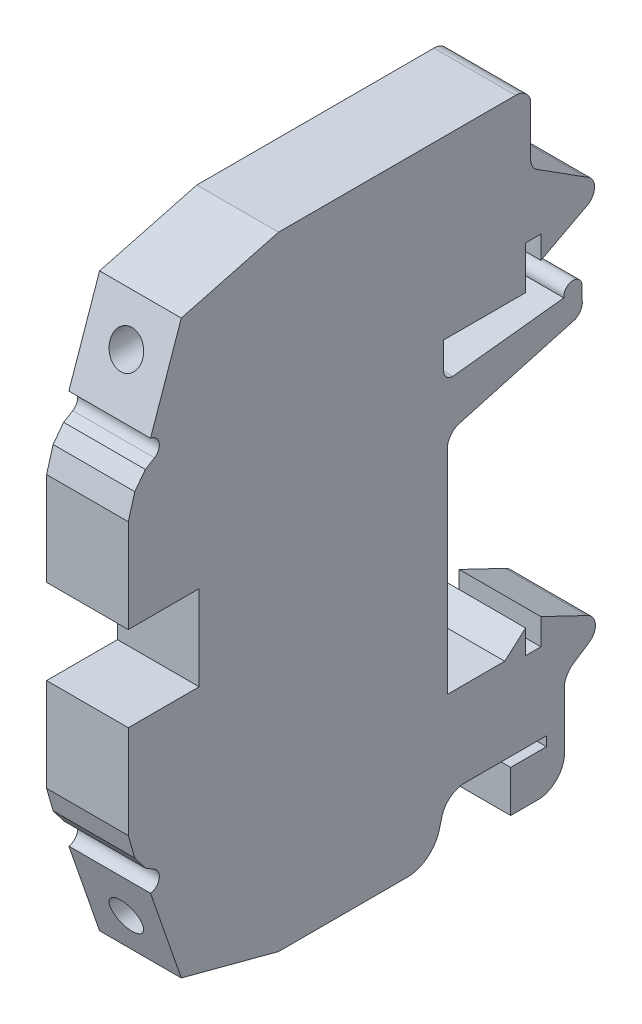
ISO-10303-21;
HEADER;
FILE_DESCRIPTION(('STEP AP214'),'2;1');
FILE_NAME('part.step','',(''),(''),'','','');
FILE_SCHEMA(('AUTOMOTIVE_DESIGN { 1 0 10303 214 1 1 1 1 }'));
ENDSEC;
DATA;
#1=APPLICATION_CONTEXT('core data for automotive mechanical design processes');
#2=APPLICATION_PROTOCOL_DEFINITION('international standard','automotive_design',2000,#1);
#3=PRODUCT_CONTEXT('',#1,'mechanical');
#4=PRODUCT('Part','Part','',(#3));
#5=PRODUCT_RELATED_PRODUCT_CATEGORY('part','',(#4));
#6=PRODUCT_DEFINITION_FORMATION('','',#4);
#7=PRODUCT_DEFINITION_CONTEXT('part definition',#1,'design');
#8=PRODUCT_DEFINITION('design','',#6,#7);
#9=PRODUCT_DEFINITION_SHAPE('','',#8);
#10=(LENGTH_UNIT() NAMED_UNIT(*) SI_UNIT(.MILLI.,.METRE.));
#11=(NAMED_UNIT(*) PLANE_ANGLE_UNIT() SI_UNIT($,.RADIAN.));
#12=(NAMED_UNIT(*) SI_UNIT($,.STERADIAN.) SOLID_ANGLE_UNIT());
#13=UNCERTAINTY_MEASURE_WITH_UNIT(LENGTH_MEASURE(1.E-05),#10,'distance_accuracy_value','');
#14=(GEOMETRIC_REPRESENTATION_CONTEXT(3) GLOBAL_UNCERTAINTY_ASSIGNED_CONTEXT((#13)) GLOBAL_UNIT_ASSIGNED_CONTEXT((#10,
#11,#12)) REPRESENTATION_CONTEXT('',''));
#15=CARTESIAN_POINT('',(0.,0.,0.));
#16=DIRECTION('',(0.,0.,1.));
#17=DIRECTION('',(1.,0.,0.));
#18=AXIS2_PLACEMENT_3D('',#15,#16,#17);
#19=CARTESIAN_POINT('',(-8.,-4.19679744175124,38.9));
#20=DIRECTION('',(0.,0.,1.));
#21=DIRECTION('',(-1.,0.,0.));
#22=AXIS2_PLACEMENT_3D('',#19,#20,#21);
#23=PLANE('',#22);
#24=DIRECTION('',(0.,-1.,0.));
#25=VECTOR('',#24,1.);
#26=CARTESIAN_POINT('',(0.,-4.19679744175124,38.9));
#27=LINE('',#26,#25);
#28=CARTESIAN_POINT('',(0.,-4.19679744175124,38.9));
#29=VERTEX_POINT('',#28);
#30=CARTESIAN_POINT('',(0.,-13.3380259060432,38.9));
#31=VERTEX_POINT('',#30);
#32=EDGE_CURVE('E397',#29,#31,#27,.T.);
#33=ORIENTED_EDGE('',*,*,#32,.F.);
#34=DIRECTION('',(1.,0.,0.));
#35=VECTOR('',#34,1.);
#36=CARTESIAN_POINT('',(-8.,-4.19679744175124,38.9));
#37=LINE('',#36,#35);
#38=CARTESIAN_POINT('',(-8.,-4.19679744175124,38.9));
#39=VERTEX_POINT('',#38);
#40=EDGE_CURVE('E11',#39,#29,#37,.T.);
#41=ORIENTED_EDGE('',*,*,#40,.F.);
#42=DIRECTION('',(0.,-1.,0.));
#43=VECTOR('',#42,1.);
#44=CARTESIAN_POINT('',(-8.,-4.19679744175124,38.9));
#45=LINE('',#44,#43);
#46=CARTESIAN_POINT('',(-8.,-13.3380259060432,38.9));
#47=VERTEX_POINT('',#46);
#48=EDGE_CURVE('E621',#39,#47,#45,.T.);
#49=ORIENTED_EDGE('',*,*,#48,.T.);
#50=DIRECTION('',(1.,0.,0.));
#51=VECTOR('',#50,1.);
#52=CARTESIAN_POINT('',(-8.,-13.3380259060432,38.9));
#53=LINE('',#52,#51);
#54=EDGE_CURVE('E389',#47,#31,#53,.T.);
#55=ORIENTED_EDGE('',*,*,#54,.T.);
#56=EDGE_LOOP('',(#33,#41,#49,#55));
#57=FACE_BOUND('',#56,.T.);
#58=ADVANCED_FACE('F16',(#57),#23,.T.);
#59=CARTESIAN_POINT('',(-8.,-1.96758560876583,38.2585401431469));
#60=DIRECTION('',(0.,0.276530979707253,0.961005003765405));
#61=DIRECTION('',(0.,0.961005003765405,-0.276530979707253));
#62=AXIS2_PLACEMENT_3D('',#59,#60,#61);
#63=PLANE('',#62);
#64=DIRECTION('',(0.,-0.961005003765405,0.276530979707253));
#65=VECTOR('',#64,1.);
#66=CARTESIAN_POINT('',(0.,-1.96758560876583,38.2585401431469));
#67=LINE('',#66,#65);
#68=CARTESIAN_POINT('',(0.,-1.96758560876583,38.2585401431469));
#69=VERTEX_POINT('',#68);
#70=EDGE_CURVE('E618',#69,#29,#67,.T.);
#71=ORIENTED_EDGE('',*,*,#70,.F.);
#72=DIRECTION('',(1.,0.,0.));
#73=VECTOR('',#72,1.);
#74=CARTESIAN_POINT('',(-8.,-1.96758560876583,38.2585401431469));
#75=LINE('',#74,#73);
#76=CARTESIAN_POINT('',(-8.,-1.96758560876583,38.2585401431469));
#77=VERTEX_POINT('',#76);
#78=EDGE_CURVE('E25',#77,#69,#75,.T.);
#79=ORIENTED_EDGE('',*,*,#78,.F.);
#80=DIRECTION('',(0.,-0.961005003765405,0.276530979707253));
#81=VECTOR('',#80,1.);
#82=CARTESIAN_POINT('',(-8.,-1.96758560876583,38.2585401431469));
#83=LINE('',#82,#81);
#84=EDGE_CURVE('E828',#77,#39,#83,.T.);
#85=ORIENTED_EDGE('',*,*,#84,.T.);
#86=ORIENTED_EDGE('',*,*,#40,.T.);
#87=EDGE_LOOP('',(#71,#79,#85,#86));
#88=FACE_BOUND('',#87,.T.);
#89=ADVANCED_FACE('F1035',(#88),#63,.T.);
#90=CARTESIAN_POINT('',(-8.,-0.599660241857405,37.2288282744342));
#91=DIRECTION('',(0.,0.601407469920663,0.798942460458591));
#92=DIRECTION('',(0.,0.798942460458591,-0.601407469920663));
#93=AXIS2_PLACEMENT_3D('',#90,#91,#92);
#94=PLANE('',#93);
#95=DIRECTION('',(0.,-0.798942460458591,0.601407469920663));
#96=VECTOR('',#95,1.);
#97=CARTESIAN_POINT('',(0.,-0.599660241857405,37.2288282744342));
#98=LINE('',#97,#96);
#99=CARTESIAN_POINT('',(0.,-0.599660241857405,37.2288282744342));
#100=VERTEX_POINT('',#99);
#101=EDGE_CURVE('E614',#100,#69,#98,.T.);
#102=ORIENTED_EDGE('',*,*,#101,.F.);
#103=DIRECTION('',(1.,0.,0.));
#104=VECTOR('',#103,1.);
#105=CARTESIAN_POINT('',(-8.,-0.599660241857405,37.2288282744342));
#106=LINE('',#105,#104);
#107=CARTESIAN_POINT('',(-8.,-0.599660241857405,37.2288282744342));
#108=VERTEX_POINT('',#107);
#109=EDGE_CURVE('E835',#108,#100,#106,.T.);
#110=ORIENTED_EDGE('',*,*,#109,.F.);
#111=DIRECTION('',(0.,-0.798942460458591,0.601407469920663));
#112=VECTOR('',#111,1.);
#113=CARTESIAN_POINT('',(-8.,-0.599660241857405,37.2288282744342));
#114=LINE('',#113,#112);
#115=EDGE_CURVE('E825',#108,#77,#114,.T.);
#116=ORIENTED_EDGE('',*,*,#115,.T.);
#117=ORIENTED_EDGE('',*,*,#78,.T.);
#118=EDGE_LOOP('',(#102,#110,#116,#117));
#119=FACE_BOUND('',#118,.T.);
#120=ADVANCED_FACE('F1039',(#119),#94,.T.);
#121=CARTESIAN_POINT('',(-8.,-0.059245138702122,36.3341605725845));
#122=DIRECTION('',(0.,0.855963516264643,0.517036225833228));
#123=DIRECTION('',(0.,0.517036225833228,-0.855963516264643));
#124=AXIS2_PLACEMENT_3D('',#121,#122,#123);
#125=PLANE('',#124);
#126=DIRECTION('',(0.,-0.517036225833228,0.855963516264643));
#127=VECTOR('',#126,1.);
#128=CARTESIAN_POINT('',(0.,-0.059245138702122,36.3341605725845));
#129=LINE('',#128,#127);
#130=CARTESIAN_POINT('',(0.,-0.0592451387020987,36.3341605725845));
#131=VERTEX_POINT('',#130);
#132=EDGE_CURVE('E610',#131,#100,#129,.T.);
#133=ORIENTED_EDGE('',*,*,#132,.F.);
#134=DIRECTION('',(1.,0.,0.));
#135=VECTOR('',#134,1.);
#136=CARTESIAN_POINT('',(-8.,-0.0592451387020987,36.3341605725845));
#137=LINE('',#136,#135);
#138=CARTESIAN_POINT('',(-8.,-0.0592451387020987,36.3341605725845));
#139=VERTEX_POINT('',#138);
#140=EDGE_CURVE('E838',#139,#131,#137,.T.);
#141=ORIENTED_EDGE('',*,*,#140,.F.);
#142=DIRECTION('',(0.,-0.517036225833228,0.855963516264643));
#143=VECTOR('',#142,1.);
#144=CARTESIAN_POINT('',(-8.,-0.059245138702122,36.3341605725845));
#145=LINE('',#144,#143);
#146=EDGE_CURVE('E821',#139,#108,#145,.T.);
#147=ORIENTED_EDGE('',*,*,#146,.T.);
#148=ORIENTED_EDGE('',*,*,#109,.T.);
#149=EDGE_LOOP('',(#133,#141,#147,#148));
#150=FACE_BOUND('',#149,.T.);
#151=ADVANCED_FACE('F1261',(#150),#125,.T.);
#152=CARTESIAN_POINT('',(-8.,0.794412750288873,36.8729910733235));
#153=DIRECTION('',(1.,0.,0.));
#154=DIRECTION('',(0.,1.,0.));
#155=AXIS2_PLACEMENT_3D('',#152,#153,#154);
#156=CYLINDRICAL_SURFACE('',#155,1.00949001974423);
#157=CARTESIAN_POINT('',(0.,0.794412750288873,36.8729910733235));
#158=DIRECTION('',(-1.,0.,0.));
#159=DIRECTION('',(0.,-1.,0.));
#160=AXIS2_PLACEMENT_3D('',#157,#158,#159);
#161=CIRCLE('',#160,1.00949001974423);
#162=CARTESIAN_POINT('',(0.,1.79242468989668,36.7211942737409));
#163=VERTEX_POINT('',#162);
#164=EDGE_CURVE('E606',#163,#131,#161,.T.);
#165=ORIENTED_EDGE('',*,*,#164,.F.);
#166=DIRECTION('',(1.,0.,0.));
#167=VECTOR('',#166,1.);
#168=CARTESIAN_POINT('',(-8.,1.79242468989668,36.7211942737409));
#169=LINE('',#168,#167);
#170=CARTESIAN_POINT('',(-8.,1.79242468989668,36.7211942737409));
#171=VERTEX_POINT('',#170);
#172=EDGE_CURVE('E841',#171,#163,#169,.T.);
#173=ORIENTED_EDGE('',*,*,#172,.F.);
#174=CARTESIAN_POINT('',(-8.,0.794412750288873,36.8729910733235));
#175=DIRECTION('',(-1.,0.,0.));
#176=DIRECTION('',(0.,-1.,0.));
#177=AXIS2_PLACEMENT_3D('',#174,#175,#176);
#178=CIRCLE('',#177,1.00949001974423);
#179=EDGE_CURVE('E817',#171,#139,#178,.T.);
#180=ORIENTED_EDGE('',*,*,#179,.T.);
#181=ORIENTED_EDGE('',*,*,#140,.T.);
#182=EDGE_LOOP('',(#165,#173,#180,#181));
#183=FACE_BOUND('',#182,.T.);
#184=ADVANCED_FACE('F1258',(#183),#156,.F.);
#185=CARTESIAN_POINT('',(-8.,10.4782957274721,33.710486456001));
#186=DIRECTION('',(0.,0.327504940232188,0.944849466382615));
#187=DIRECTION('',(0.,0.944849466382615,-0.327504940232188));
#188=AXIS2_PLACEMENT_3D('',#185,#186,#187);
#189=PLANE('',#188);
#190=CARTESIAN_POINT('',(-4.,6.5,35.089448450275));
#191=DIRECTION('',(0.,0.327504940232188,0.944849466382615));
#192=DIRECTION('',(0.,-0.944849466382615,0.327504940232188));
#193=AXIS2_PLACEMENT_3D('',#190,#191,#192);
#194=ELLIPSE('',#193,1.69339144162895,1.6);
#195=CARTESIAN_POINT('',(-4.,4.9,35.6440425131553));
#196=VERTEX_POINT('',#195);
#197=EDGE_CURVE('E624',#196,#196,#194,.T.);
#198=ORIENTED_EDGE('',*,*,#197,.F.);
#199=EDGE_LOOP('',(#198));
#200=FACE_BOUND('',#199,.T.);
#201=DIRECTION('',(0.,-0.944849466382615,0.327504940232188));
#202=VECTOR('',#201,1.);
#203=CARTESIAN_POINT('',(0.,10.4782957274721,33.710486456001));
#204=LINE('',#203,#202);
#205=CARTESIAN_POINT('',(0.,10.4782957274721,33.710486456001));
#206=VERTEX_POINT('',#205);
#207=EDGE_CURVE('E602',#206,#163,#204,.T.);
#208=ORIENTED_EDGE('',*,*,#207,.F.);
#209=DIRECTION('',(1.,0.,0.));
#210=VECTOR('',#209,1.);
#211=CARTESIAN_POINT('',(-8.,10.4782957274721,33.710486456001));
#212=LINE('',#211,#210);
#213=CARTESIAN_POINT('',(-8.,10.4782957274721,33.710486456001));
#214=VERTEX_POINT('',#213);
#215=EDGE_CURVE('E844',#214,#206,#212,.T.);
#216=ORIENTED_EDGE('',*,*,#215,.F.);
#217=DIRECTION('',(0.,-0.944849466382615,0.327504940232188));
#218=VECTOR('',#217,1.);
#219=CARTESIAN_POINT('',(-8.,10.4782957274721,33.710486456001));
#220=LINE('',#219,#218);
#221=EDGE_CURVE('E813',#214,#171,#220,.T.);
#222=ORIENTED_EDGE('',*,*,#221,.T.);
#223=ORIENTED_EDGE('',*,*,#172,.T.);
#224=EDGE_LOOP('',(#208,#216,#222,#223));
#225=FACE_BOUND('',#224,.T.);
#226=ADVANCED_FACE('F1254',(#200,#225),#189,.T.);
#227=CARTESIAN_POINT('',(-8.,13.0000000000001,24.1882476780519));
#228=DIRECTION('',(0.,0.966677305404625,0.255998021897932));
#229=DIRECTION('',(0.,0.255998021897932,-0.966677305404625));
#230=AXIS2_PLACEMENT_3D('',#227,#228,#229);
#231=PLANE('',#230);
#232=DIRECTION('',(0.,-0.255998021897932,0.966677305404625));
#233=VECTOR('',#232,1.);
#234=CARTESIAN_POINT('',(0.,13.0000000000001,24.1882476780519));
#235=LINE('',#234,#233);
#236=CARTESIAN_POINT('',(0.,13.0000000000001,24.1882476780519));
#237=VERTEX_POINT('',#236);
#238=EDGE_CURVE('E598',#237,#206,#235,.T.);
#239=ORIENTED_EDGE('',*,*,#238,.F.);
#240=DIRECTION('',(1.,0.,0.));
#241=VECTOR('',#240,1.);
#242=CARTESIAN_POINT('',(-8.,13.0000000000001,24.1882476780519));
#243=LINE('',#242,#241);
#244=CARTESIAN_POINT('',(-8.,13.0000000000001,24.1882476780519));
#245=VERTEX_POINT('',#244);
#246=EDGE_CURVE('E847',#245,#237,#243,.T.);
#247=ORIENTED_EDGE('',*,*,#246,.F.);
#248=DIRECTION('',(0.,-0.255998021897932,0.966677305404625));
#249=VECTOR('',#248,1.);
#250=CARTESIAN_POINT('',(-8.,13.0000000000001,24.1882476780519));
#251=LINE('',#250,#249);
#252=EDGE_CURVE('E809',#245,#214,#251,.T.);
#253=ORIENTED_EDGE('',*,*,#252,.T.);
#254=ORIENTED_EDGE('',*,*,#215,.T.);
#255=EDGE_LOOP('',(#239,#247,#253,#254));
#256=FACE_BOUND('',#255,.T.);
#257=ADVANCED_FACE('F1250',(#256),#231,.T.);
#258=CARTESIAN_POINT('',(-8.,13.0000000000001,0.977745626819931));
#259=DIRECTION('',(0.,1.,0.));
#260=DIRECTION('',(-1.,0.,0.));
#261=AXIS2_PLACEMENT_3D('',#258,#259,#260);
#262=PLANE('',#261);
#263=DIRECTION('',(0.,0.,1.));
#264=VECTOR('',#263,1.);
#265=CARTESIAN_POINT('',(0.,13.0000000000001,0.977745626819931));
#266=LINE('',#265,#264);
#267=CARTESIAN_POINT('',(0.,13.,0.977745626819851));
#268=VERTEX_POINT('',#267);
#269=EDGE_CURVE('E594',#268,#237,#266,.T.);
#270=ORIENTED_EDGE('',*,*,#269,.F.);
#271=DIRECTION('',(1.,0.,0.));
#272=VECTOR('',#271,1.);
#273=CARTESIAN_POINT('',(-8.,13.,0.977745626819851));
#274=LINE('',#273,#272);
#275=CARTESIAN_POINT('',(-8.,13.,0.977745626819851));
#276=VERTEX_POINT('',#275);
#277=EDGE_CURVE('E850',#276,#268,#274,.T.);
#278=ORIENTED_EDGE('',*,*,#277,.F.);
#279=DIRECTION('',(0.,0.,1.));
#280=VECTOR('',#279,1.);
#281=CARTESIAN_POINT('',(-8.,13.0000000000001,0.977745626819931));
#282=LINE('',#281,#280);
#283=EDGE_CURVE('E805',#276,#245,#282,.T.);
#284=ORIENTED_EDGE('',*,*,#283,.T.);
#285=ORIENTED_EDGE('',*,*,#246,.T.);
#286=EDGE_LOOP('',(#270,#278,#284,#285));
#287=FACE_BOUND('',#286,.T.);
#288=ADVANCED_FACE('F1246',(#287),#262,.T.);
#289=CARTESIAN_POINT('',(-8.,11.4851974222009,0.973039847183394));
#290=DIRECTION('',(1.,0.,0.));
#291=DIRECTION('',(0.,1.,0.));
#292=AXIS2_PLACEMENT_3D('',#289,#290,#291);
#293=CYLINDRICAL_SURFACE('',#292,1.51480988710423);
#294=CARTESIAN_POINT('',(0.,11.4851974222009,0.973039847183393));
#295=DIRECTION('',(-1.,0.,0.));
#296=DIRECTION('',(0.,-1.,0.));
#297=AXIS2_PLACEMENT_3D('',#294,#295,#296);
#298=CIRCLE('',#297,1.51480988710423);
#299=CARTESIAN_POINT('',(0.,11.8383858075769,-0.500020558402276));
#300=VERTEX_POINT('',#299);
#301=EDGE_CURVE('E591',#268,#300,#298,.T.);
#302=ORIENTED_EDGE('',*,*,#301,.T.);
#303=DIRECTION('',(1.,0.,0.));
#304=VECTOR('',#303,1.);
#305=CARTESIAN_POINT('',(-8.,11.8383858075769,-0.500020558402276));
#306=LINE('',#305,#304);
#307=CARTESIAN_POINT('',(-8.,11.8383858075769,-0.500020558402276));
#308=VERTEX_POINT('',#307);
#309=EDGE_CURVE('E853',#308,#300,#306,.T.);
#310=ORIENTED_EDGE('',*,*,#309,.F.);
#311=CARTESIAN_POINT('',(-8.,11.4851974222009,0.973039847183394));
#312=DIRECTION('',(-1.,0.,0.));
#313=DIRECTION('',(0.,-1.,0.));
#314=AXIS2_PLACEMENT_3D('',#311,#312,#313);
#315=CIRCLE('',#314,1.51480988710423);
#316=EDGE_CURVE('E802',#276,#308,#315,.T.);
#317=ORIENTED_EDGE('',*,*,#316,.F.);
#318=ORIENTED_EDGE('',*,*,#277,.T.);
#319=EDGE_LOOP('',(#302,#310,#317,#318));
#320=FACE_BOUND('',#319,.T.);
#321=ADVANCED_FACE('F1242',(#320),#293,.T.);
#322=CARTESIAN_POINT('',(-8.,11.8383858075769,-0.500020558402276));
#323=DIRECTION('',(0.,0.,1.));
#324=DIRECTION('',(0.,1.,0.));
#325=AXIS2_PLACEMENT_3D('',#322,#323,#324);
#326=PLANE('',#325);
#327=DIRECTION('',(0.,-1.,0.));
#328=VECTOR('',#327,1.);
#329=CARTESIAN_POINT('',(0.,11.8383858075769,-0.500020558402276));
#330=LINE('',#329,#328);
#331=CARTESIAN_POINT('',(0.,6.82065230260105,-0.500020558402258));
#332=VERTEX_POINT('',#331);
#333=EDGE_CURVE('E587',#300,#332,#330,.T.);
#334=ORIENTED_EDGE('',*,*,#333,.T.);
#335=DIRECTION('',(1.,0.,0.));
#336=VECTOR('',#335,1.);
#337=CARTESIAN_POINT('',(-8.,6.82065230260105,-0.500020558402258));
#338=LINE('',#337,#336);
#339=CARTESIAN_POINT('',(-8.,6.82065230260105,-0.500020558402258));
#340=VERTEX_POINT('',#339);
#341=EDGE_CURVE('E857',#340,#332,#338,.T.);
#342=ORIENTED_EDGE('',*,*,#341,.F.);
#343=DIRECTION('',(0.,-1.,0.));
#344=VECTOR('',#343,1.);
#345=CARTESIAN_POINT('',(-8.,11.8383858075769,-0.500020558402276));
#346=LINE('',#345,#344);
#347=EDGE_CURVE('E799',#308,#340,#346,.T.);
#348=ORIENTED_EDGE('',*,*,#347,.F.);
#349=ORIENTED_EDGE('',*,*,#309,.T.);
#350=EDGE_LOOP('',(#334,#342,#348,#349));
#351=FACE_BOUND('',#350,.T.);
#352=ADVANCED_FACE('F1238',(#351),#326,.F.);
#353=CARTESIAN_POINT('',(-8.,6.7878548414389,-1.82078035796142));
#354=DIRECTION('',(1.,0.,0.));
#355=DIRECTION('',(0.,1.,0.));
#356=AXIS2_PLACEMENT_3D('',#353,#354,#355);
#357=CYLINDRICAL_SURFACE('',#356,1.32116695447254);
#358=CARTESIAN_POINT('',(0.,6.7878548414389,-1.82078035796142));
#359=DIRECTION('',(-1.,0.,0.));
#360=DIRECTION('',(0.,-1.,0.));
#361=AXIS2_PLACEMENT_3D('',#358,#359,#360);
#362=CIRCLE('',#361,1.32116695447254);
#363=CARTESIAN_POINT('',(0.,5.71183884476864,-1.05418287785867));
#364=VERTEX_POINT('',#363);
#365=EDGE_CURVE('E583',#364,#332,#362,.T.);
#366=ORIENTED_EDGE('',*,*,#365,.F.);
#367=DIRECTION('',(1.,0.,0.));
#368=VECTOR('',#367,1.);
#369=CARTESIAN_POINT('',(-8.,5.71183884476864,-1.05418287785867));
#370=LINE('',#369,#368);
#371=CARTESIAN_POINT('',(-8.,5.71183884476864,-1.05418287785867));
#372=VERTEX_POINT('',#371);
#373=EDGE_CURVE('E860',#372,#364,#370,.T.);
#374=ORIENTED_EDGE('',*,*,#373,.F.);
#375=CARTESIAN_POINT('',(-8.,6.7878548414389,-1.82078035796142));
#376=DIRECTION('',(-1.,0.,0.));
#377=DIRECTION('',(0.,-1.,0.));
#378=AXIS2_PLACEMENT_3D('',#375,#376,#377);
#379=CIRCLE('',#378,1.32116695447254);
#380=EDGE_CURVE('E795',#372,#340,#379,.T.);
#381=ORIENTED_EDGE('',*,*,#380,.T.);
#382=ORIENTED_EDGE('',*,*,#341,.T.);
#383=EDGE_LOOP('',(#366,#374,#381,#382));
#384=FACE_BOUND('',#383,.T.);
#385=ADVANCED_FACE('F1233',(#384),#357,.F.);
#386=CARTESIAN_POINT('',(-8.,2.62300098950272,-5.90970047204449));
#387=DIRECTION('',(0.,0.843743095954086,-0.536747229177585));
#388=DIRECTION('',(0.,-0.536747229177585,-0.843743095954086));
#389=AXIS2_PLACEMENT_3D('',#386,#387,#388);
#390=PLANE('',#389);
#391=DIRECTION('',(0.,0.536747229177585,0.843743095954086));
#392=VECTOR('',#391,1.);
#393=CARTESIAN_POINT('',(0.,2.62300098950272,-5.90970047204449));
#394=LINE('',#393,#392);
#395=CARTESIAN_POINT('',(0.,2.62300098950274,-5.90970047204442));
#396=VERTEX_POINT('',#395);
#397=EDGE_CURVE('E579',#396,#364,#394,.T.);
#398=ORIENTED_EDGE('',*,*,#397,.F.);
#399=DIRECTION('',(1.,0.,0.));
#400=VECTOR('',#399,1.);
#401=CARTESIAN_POINT('',(-8.,2.62300098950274,-5.90970047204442));
#402=LINE('',#401,#400);
#403=CARTESIAN_POINT('',(-8.,2.62300098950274,-5.90970047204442));
#404=VERTEX_POINT('',#403);
#405=EDGE_CURVE('E863',#404,#396,#402,.T.);
#406=ORIENTED_EDGE('',*,*,#405,.F.);
#407=DIRECTION('',(0.,0.536747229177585,0.843743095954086));
#408=VECTOR('',#407,1.);
#409=CARTESIAN_POINT('',(-8.,2.62300098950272,-5.90970047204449));
#410=LINE('',#409,#408);
#411=EDGE_CURVE('E791',#404,#372,#410,.T.);
#412=ORIENTED_EDGE('',*,*,#411,.T.);
#413=ORIENTED_EDGE('',*,*,#373,.T.);
#414=EDGE_LOOP('',(#398,#406,#412,#413));
#415=FACE_BOUND('',#414,.T.);
#416=ADVANCED_FACE('F1228',(#415),#390,.T.);
#417=CARTESIAN_POINT('',(-8.,1.35863061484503,-5.38683092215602));
#418=DIRECTION('',(1.,0.,0.));
#419=DIRECTION('',(0.,1.,0.));
#420=AXIS2_PLACEMENT_3D('',#417,#418,#419);
#421=CYLINDRICAL_SURFACE('',#420,1.3682196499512);
#422=CARTESIAN_POINT('',(0.,1.35863061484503,-5.38683092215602));
#423=DIRECTION('',(-1.,0.,0.));
#424=DIRECTION('',(0.,-1.,0.));
#425=AXIS2_PLACEMENT_3D('',#422,#423,#424);
#426=CIRCLE('',#425,1.3682196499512);
#427=CARTESIAN_POINT('',(0.,0.105601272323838,-5.93632384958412));
#428=VERTEX_POINT('',#427);
#429=EDGE_CURVE('E575',#396,#428,#426,.T.);
#430=ORIENTED_EDGE('',*,*,#429,.T.);
#431=DIRECTION('',(1.,0.,0.));
#432=VECTOR('',#431,1.);
#433=CARTESIAN_POINT('',(-8.,0.105601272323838,-5.93632384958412));
#434=LINE('',#433,#432);
#435=CARTESIAN_POINT('',(-8.,0.105601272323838,-5.93632384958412));
#436=VERTEX_POINT('',#435);
#437=EDGE_CURVE('E866',#436,#428,#434,.T.);
#438=ORIENTED_EDGE('',*,*,#437,.F.);
#439=CARTESIAN_POINT('',(-8.,1.35863061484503,-5.38683092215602));
#440=DIRECTION('',(-1.,0.,0.));
#441=DIRECTION('',(0.,-1.,0.));
#442=AXIS2_PLACEMENT_3D('',#439,#440,#441);
#443=CIRCLE('',#442,1.3682196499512);
#444=EDGE_CURVE('E788',#404,#436,#443,.T.);
#445=ORIENTED_EDGE('',*,*,#444,.F.);
#446=ORIENTED_EDGE('',*,*,#405,.T.);
#447=EDGE_LOOP('',(#430,#438,#445,#446));
#448=FACE_BOUND('',#447,.T.);
#449=ADVANCED_FACE('F1225',(#448),#421,.T.);
#450=CARTESIAN_POINT('',(-8.,-2.23685381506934,-1.5));
#451=DIRECTION('',(0.,-0.884297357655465,-0.466924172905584));
#452=DIRECTION('',(0.,-0.466924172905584,0.884297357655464));
#453=AXIS2_PLACEMENT_3D('',#450,#451,#452);
#454=PLANE('',#453);
#455=DIRECTION('',(0.,0.466924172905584,-0.884297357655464));
#456=VECTOR('',#455,1.);
#457=CARTESIAN_POINT('',(0.,-2.23685381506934,-1.5));
#458=LINE('',#457,#456);
#459=CARTESIAN_POINT('',(0.,-2.23685381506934,-1.5));
#460=VERTEX_POINT('',#459);
#461=EDGE_CURVE('E571',#460,#428,#458,.T.);
#462=ORIENTED_EDGE('',*,*,#461,.F.);
#463=DIRECTION('',(1.,0.,0.));
#464=VECTOR('',#463,1.);
#465=CARTESIAN_POINT('',(-8.,-2.23685381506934,-1.5));
#466=LINE('',#465,#464);
#467=CARTESIAN_POINT('',(-8.,-2.23685381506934,-1.5));
#468=VERTEX_POINT('',#467);
#469=EDGE_CURVE('E869',#468,#460,#466,.T.);
#470=ORIENTED_EDGE('',*,*,#469,.F.);
#471=DIRECTION('',(0.,0.466924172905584,-0.884297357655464));
#472=VECTOR('',#471,1.);
#473=CARTESIAN_POINT('',(-8.,-2.23685381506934,-1.5));
#474=LINE('',#473,#472);
#475=EDGE_CURVE('E784',#468,#436,#474,.T.);
#476=ORIENTED_EDGE('',*,*,#475,.T.);
#477=ORIENTED_EDGE('',*,*,#437,.T.);
#478=EDGE_LOOP('',(#462,#470,#476,#477));
#479=FACE_BOUND('',#478,.T.);
#480=ADVANCED_FACE('F1220',(#479),#454,.T.);
#481=CARTESIAN_POINT('',(-8.,0.,-1.5));
#482=DIRECTION('',(0.,0.,1.));
#483=DIRECTION('',(0.,1.,0.));
#484=AXIS2_PLACEMENT_3D('',#481,#482,#483);
#485=PLANE('',#484);
#486=DIRECTION('',(0.,-1.,0.));
#487=VECTOR('',#486,1.);
#488=CARTESIAN_POINT('',(0.,0.,-1.5));
#489=LINE('',#488,#487);
#490=CARTESIAN_POINT('',(0.,0.,-1.5));
#491=VERTEX_POINT('',#490);
#492=EDGE_CURVE('E567',#491,#460,#489,.T.);
#493=ORIENTED_EDGE('',*,*,#492,.F.);
#494=DIRECTION('',(1.,0.,0.));
#495=VECTOR('',#494,1.);
#496=CARTESIAN_POINT('',(-8.,0.,-1.5));
#497=LINE('',#496,#495);
#498=CARTESIAN_POINT('',(-8.,0.,-1.5));
#499=VERTEX_POINT('',#498);
#500=EDGE_CURVE('E872',#499,#491,#497,.T.);
#501=ORIENTED_EDGE('',*,*,#500,.F.);
#502=DIRECTION('',(0.,-1.,0.));
#503=VECTOR('',#502,1.);
#504=CARTESIAN_POINT('',(-8.,0.,-1.5));
#505=LINE('',#504,#503);
#506=EDGE_CURVE('E780',#499,#468,#505,.T.);
#507=ORIENTED_EDGE('',*,*,#506,.T.);
#508=ORIENTED_EDGE('',*,*,#469,.T.);
#509=EDGE_LOOP('',(#493,#501,#507,#508));
#510=FACE_BOUND('',#509,.T.);
#511=ADVANCED_FACE('F1215',(#510),#485,.T.);
#512=CARTESIAN_POINT('',(-8.,0.,0.));
#513=DIRECTION('',(0.,-1.,0.));
#514=DIRECTION('',(1.,0.,0.));
#515=AXIS2_PLACEMENT_3D('',#512,#513,#514);
#516=PLANE('',#515);
#517=DIRECTION('',(0.,0.,-1.));
#518=VECTOR('',#517,1.);
#519=CARTESIAN_POINT('',(0.,0.,0.));
#520=LINE('',#519,#518);
#521=CARTESIAN_POINT('',(0.,0.,0.));
#522=VERTEX_POINT('',#521);
#523=EDGE_CURVE('E563',#522,#491,#520,.T.);
#524=ORIENTED_EDGE('',*,*,#523,.F.);
#525=DIRECTION('',(1.,0.,0.));
#526=VECTOR('',#525,1.);
#527=CARTESIAN_POINT('',(-8.,0.,0.));
#528=LINE('',#527,#526);
#529=CARTESIAN_POINT('',(-8.,0.,0.));
#530=VERTEX_POINT('',#529);
#531=EDGE_CURVE('E875',#530,#522,#528,.T.);
#532=ORIENTED_EDGE('',*,*,#531,.F.);
#533=DIRECTION('',(0.,0.,-1.));
#534=VECTOR('',#533,1.);
#535=CARTESIAN_POINT('',(-8.,0.,0.));
#536=LINE('',#535,#534);
#537=EDGE_CURVE('E776',#530,#499,#536,.T.);
#538=ORIENTED_EDGE('',*,*,#537,.T.);
#539=ORIENTED_EDGE('',*,*,#500,.T.);
#540=EDGE_LOOP('',(#524,#532,#538,#539));
#541=FACE_BOUND('',#540,.T.);
#542=ADVANCED_FACE('F1210',(#541),#516,.T.);
#543=CARTESIAN_POINT('',(-8.,0.,0.));
#544=DIRECTION('',(0.,0.,1.));
#545=DIRECTION('',(-1.,0.,0.));
#546=AXIS2_PLACEMENT_3D('',#543,#544,#545);
#547=PLANE('',#546);
#548=DIRECTION('',(0.,-1.,0.));
#549=VECTOR('',#548,1.);
#550=CARTESIAN_POINT('',(0.,0.,0.));
#551=LINE('',#550,#549);
#552=CARTESIAN_POINT('',(0.,-4.22405148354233,0.));
#553=VERTEX_POINT('',#552);
#554=EDGE_CURVE('E559',#522,#553,#551,.T.);
#555=ORIENTED_EDGE('',*,*,#554,.T.);
#556=DIRECTION('',(1.,0.,0.));
#557=VECTOR('',#556,1.);
#558=CARTESIAN_POINT('',(-8.,-4.22405148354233,0.));
#559=LINE('',#558,#557);
#560=CARTESIAN_POINT('',(-8.,-4.22405148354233,0.));
#561=VERTEX_POINT('',#560);
#562=EDGE_CURVE('E878',#561,#553,#559,.T.);
#563=ORIENTED_EDGE('',*,*,#562,.F.);
#564=DIRECTION('',(0.,-1.,0.));
#565=VECTOR('',#564,1.);
#566=CARTESIAN_POINT('',(-8.,0.,0.));
#567=LINE('',#566,#565);
#568=EDGE_CURVE('E773',#530,#561,#567,.T.);
#569=ORIENTED_EDGE('',*,*,#568,.F.);
#570=ORIENTED_EDGE('',*,*,#531,.T.);
#571=EDGE_LOOP('',(#555,#563,#569,#570));
#572=FACE_BOUND('',#571,.T.);
#573=ADVANCED_FACE('F1207',(#572),#547,.F.);
#574=CARTESIAN_POINT('',(-8.,-4.22405148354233,8.02328912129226));
#575=DIRECTION('',(0.,-1.,0.));
#576=DIRECTION('',(1.,0.,0.));
#577=AXIS2_PLACEMENT_3D('',#574,#575,#576);
#578=PLANE('',#577);
#579=DIRECTION('',(0.,0.,-1.));
#580=VECTOR('',#579,1.);
#581=CARTESIAN_POINT('',(0.,-4.22405148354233,8.02328912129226));
#582=LINE('',#581,#580);
#583=CARTESIAN_POINT('',(0.,-4.22405148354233,8.02328912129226));
#584=VERTEX_POINT('',#583);
#585=EDGE_CURVE('E555',#584,#553,#582,.T.);
#586=ORIENTED_EDGE('',*,*,#585,.F.);
#587=DIRECTION('',(1.,0.,0.));
#588=VECTOR('',#587,1.);
#589=CARTESIAN_POINT('',(-8.,-4.22405148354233,8.02328912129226));
#590=LINE('',#589,#588);
#591=CARTESIAN_POINT('',(-8.,-4.22405148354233,8.02328912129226));
#592=VERTEX_POINT('',#591);
#593=EDGE_CURVE('E881',#592,#584,#590,.T.);
#594=ORIENTED_EDGE('',*,*,#593,.F.);
#595=DIRECTION('',(0.,0.,-1.));
#596=VECTOR('',#595,1.);
#597=CARTESIAN_POINT('',(-8.,-4.22405148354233,8.02328912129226));
#598=LINE('',#597,#596);
#599=EDGE_CURVE('E769',#592,#561,#598,.T.);
#600=ORIENTED_EDGE('',*,*,#599,.T.);
#601=ORIENTED_EDGE('',*,*,#562,.T.);
#602=EDGE_LOOP('',(#586,#594,#600,#601));
#603=FACE_BOUND('',#602,.T.);
#604=ADVANCED_FACE('F1201',(#603),#578,.T.);
#605=CARTESIAN_POINT('',(-8.,-4.22405148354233,8.02328912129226));
#606=DIRECTION('',(0.,1.47320376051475E-13,1.));
#607=DIRECTION('',(0.,1.,-1.47320376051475E-13));
#608=AXIS2_PLACEMENT_3D('',#605,#606,#607);
#609=PLANE('',#608);
#610=DIRECTION('',(0.,-1.,1.47320376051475E-13));
#611=VECTOR('',#610,1.);
#612=CARTESIAN_POINT('',(0.,-4.22405148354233,8.02328912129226));
#613=LINE('',#612,#611);
#614=CARTESIAN_POINT('',(0.,-6.90048405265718,8.02328912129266));
#615=VERTEX_POINT('',#614);
#616=EDGE_CURVE('E551',#584,#615,#613,.T.);
#617=ORIENTED_EDGE('',*,*,#616,.T.);
#618=DIRECTION('',(1.,0.,0.));
#619=VECTOR('',#618,1.);
#620=CARTESIAN_POINT('',(-8.,-6.90048405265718,8.02328912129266));
#621=LINE('',#620,#619);
#622=CARTESIAN_POINT('',(-8.,-6.90048405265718,8.02328912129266));
#623=VERTEX_POINT('',#622);
#624=EDGE_CURVE('E884',#623,#615,#621,.T.);
#625=ORIENTED_EDGE('',*,*,#624,.F.);
#626=DIRECTION('',(0.,-1.,1.47320376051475E-13));
#627=VECTOR('',#626,1.);
#628=CARTESIAN_POINT('',(-8.,-4.22405148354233,8.02328912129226));
#629=LINE('',#628,#627);
#630=EDGE_CURVE('E766',#592,#623,#629,.T.);
#631=ORIENTED_EDGE('',*,*,#630,.F.);
#632=ORIENTED_EDGE('',*,*,#593,.T.);
#633=EDGE_LOOP('',(#617,#625,#631,#632));
#634=FACE_BOUND('',#633,.T.);
#635=ADVANCED_FACE('F1300',(#634),#609,.F.);
#636=CARTESIAN_POINT('',(-8.,-6.85640811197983,7.12712219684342));
#637=DIRECTION('',(1.,0.,0.));
#638=DIRECTION('',(0.,1.,0.));
#639=AXIS2_PLACEMENT_3D('',#636,#637,#638);
#640=CYLINDRICAL_SURFACE('',#639,0.897250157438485);
#641=CARTESIAN_POINT('',(0.,-6.85640811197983,7.12712219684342));
#642=DIRECTION('',(-1.,0.,0.));
#643=DIRECTION('',(0.,-1.,0.));
#644=AXIS2_PLACEMENT_3D('',#641,#642,#643);
#645=CIRCLE('',#644,0.897250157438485);
#646=CARTESIAN_POINT('',(0.,-7.75365765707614,7.12607393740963));
#647=VERTEX_POINT('',#646);
#648=EDGE_CURVE('E547',#647,#615,#645,.T.);
#649=ORIENTED_EDGE('',*,*,#648,.F.);
#650=DIRECTION('',(1.,0.,0.));
#651=VECTOR('',#650,1.);
#652=CARTESIAN_POINT('',(-8.,-7.75365765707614,7.12607393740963));
#653=LINE('',#652,#651);
#654=CARTESIAN_POINT('',(-8.,-7.75365765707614,7.12607393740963));
#655=VERTEX_POINT('',#654);
#656=EDGE_CURVE('E887',#655,#647,#653,.T.);
#657=ORIENTED_EDGE('',*,*,#656,.F.);
#658=CARTESIAN_POINT('',(-8.,-6.85640811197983,7.12712219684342));
#659=DIRECTION('',(-1.,0.,0.));
#660=DIRECTION('',(0.,-1.,0.));
#661=AXIS2_PLACEMENT_3D('',#658,#659,#660);
#662=CIRCLE('',#661,0.897250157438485);
#663=EDGE_CURVE('E762',#655,#623,#662,.T.);
#664=ORIENTED_EDGE('',*,*,#663,.T.);
#665=ORIENTED_EDGE('',*,*,#624,.T.);
#666=EDGE_LOOP('',(#649,#657,#664,#665));
#667=FACE_BOUND('',#666,.T.);
#668=ADVANCED_FACE('F1194',(#667),#640,.F.);
#669=CARTESIAN_POINT('',(-8.,-6.53924292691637,-3.74606312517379));
#670=DIRECTION('',(0.,0.993819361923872,0.111009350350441));
#671=DIRECTION('',(0.,0.111009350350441,-0.993819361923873));
#672=AXIS2_PLACEMENT_3D('',#669,#670,#671);
#673=PLANE('',#672);
#674=DIRECTION('',(0.,-0.111009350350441,0.993819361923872));
#675=VECTOR('',#674,1.);
#676=CARTESIAN_POINT('',(0.,-6.53924292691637,-3.74606312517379));
#677=LINE('',#676,#675);
#678=CARTESIAN_POINT('',(0.,-6.5392429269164,-3.74606312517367));
#679=VERTEX_POINT('',#678);
#680=EDGE_CURVE('E543',#679,#647,#677,.T.);
#681=ORIENTED_EDGE('',*,*,#680,.F.);
#682=DIRECTION('',(1.,0.,0.));
#683=VECTOR('',#682,1.);
#684=CARTESIAN_POINT('',(-8.,-6.5392429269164,-3.74606312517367));
#685=LINE('',#684,#683);
#686=CARTESIAN_POINT('',(-8.,-6.5392429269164,-3.74606312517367));
#687=VERTEX_POINT('',#686);
#688=EDGE_CURVE('E890',#687,#679,#685,.T.);
#689=ORIENTED_EDGE('',*,*,#688,.F.);
#690=DIRECTION('',(0.,-0.111009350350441,0.993819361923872));
#691=VECTOR('',#690,1.);
#692=CARTESIAN_POINT('',(-8.,-6.53924292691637,-3.74606312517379));
#693=LINE('',#692,#691);
#694=EDGE_CURVE('E758',#687,#655,#693,.T.);
#695=ORIENTED_EDGE('',*,*,#694,.T.);
#696=ORIENTED_EDGE('',*,*,#656,.T.);
#697=EDGE_LOOP('',(#681,#689,#695,#696));
#698=FACE_BOUND('',#697,.T.);
#699=ADVANCED_FACE('F1188',(#698),#673,.T.);
#700=CARTESIAN_POINT('',(-8.,-6.41153133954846,-4.63938940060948));
#701=DIRECTION('',(1.,0.,0.));
#702=DIRECTION('',(0.,1.,0.));
#703=AXIS2_PLACEMENT_3D('',#700,#701,#702);
#704=CYLINDRICAL_SURFACE('',#703,0.902409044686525);
#705=CARTESIAN_POINT('',(0.,-6.41153133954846,-4.63938940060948));
#706=DIRECTION('',(-1.,0.,0.));
#707=DIRECTION('',(0.,-1.,0.));
#708=AXIS2_PLACEMENT_3D('',#705,#706,#707);
#709=CIRCLE('',#708,0.902409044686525);
#710=CARTESIAN_POINT('',(0.,-6.46004182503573,-5.54049362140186));
#711=VERTEX_POINT('',#710);
#712=EDGE_CURVE('E539',#679,#711,#709,.T.);
#713=ORIENTED_EDGE('',*,*,#712,.T.);
#714=DIRECTION('',(1.,0.,0.));
#715=VECTOR('',#714,1.);
#716=CARTESIAN_POINT('',(-8.,-6.46004182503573,-5.54049362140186));
#717=LINE('',#716,#715);
#718=CARTESIAN_POINT('',(-8.,-6.46004182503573,-5.54049362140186));
#719=VERTEX_POINT('',#718);
#720=EDGE_CURVE('E893',#719,#711,#717,.T.);
#721=ORIENTED_EDGE('',*,*,#720,.F.);
#722=CARTESIAN_POINT('',(-8.,-6.41153133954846,-4.63938940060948));
#723=DIRECTION('',(-1.,0.,0.));
#724=DIRECTION('',(0.,-1.,0.));
#725=AXIS2_PLACEMENT_3D('',#722,#723,#724);
#726=CIRCLE('',#725,0.902409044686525);
#727=EDGE_CURVE('E755',#687,#719,#726,.T.);
#728=ORIENTED_EDGE('',*,*,#727,.F.);
#729=ORIENTED_EDGE('',*,*,#688,.T.);
#730=EDGE_LOOP('',(#713,#721,#728,#729));
#731=FACE_BOUND('',#730,.T.);
#732=ADVANCED_FACE('F1307',(#731),#704,.T.);
#733=CARTESIAN_POINT('',(-8.,-7.62165601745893,-5.54049362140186));
#734=DIRECTION('',(0.,0.,-1.));
#735=DIRECTION('',(1.,0.,0.));
#736=AXIS2_PLACEMENT_3D('',#733,#734,#735);
#737=PLANE('',#736);
#738=DIRECTION('',(0.,1.,0.));
#739=VECTOR('',#738,1.);
#740=CARTESIAN_POINT('',(0.,-7.62165601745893,-5.54049362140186));
#741=LINE('',#740,#739);
#742=CARTESIAN_POINT('',(0.,-7.62165601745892,-5.54049362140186));
#743=VERTEX_POINT('',#742);
#744=EDGE_CURVE('E535',#743,#711,#741,.T.);
#745=ORIENTED_EDGE('',*,*,#744,.F.);
#746=DIRECTION('',(1.,0.,0.));
#747=VECTOR('',#746,1.);
#748=CARTESIAN_POINT('',(-8.,-7.62165601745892,-5.54049362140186));
#749=LINE('',#748,#747);
#750=CARTESIAN_POINT('',(-8.,-7.62165601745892,-5.54049362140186));
#751=VERTEX_POINT('',#750);
#752=EDGE_CURVE('E896',#751,#743,#749,.T.);
#753=ORIENTED_EDGE('',*,*,#752,.F.);
#754=DIRECTION('',(0.,1.,0.));
#755=VECTOR('',#754,1.);
#756=CARTESIAN_POINT('',(-8.,-7.62165601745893,-5.54049362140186));
#757=LINE('',#756,#755);
#758=EDGE_CURVE('E751',#751,#719,#757,.T.);
#759=ORIENTED_EDGE('',*,*,#758,.T.);
#760=ORIENTED_EDGE('',*,*,#720,.T.);
#761=EDGE_LOOP('',(#745,#753,#759,#760));
#762=FACE_BOUND('',#761,.T.);
#763=ADVANCED_FACE('F1182',(#762),#737,.T.);
#764=CARTESIAN_POINT('',(-8.,-7.81203714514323,-4.33687234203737));
#765=DIRECTION('',(1.,0.,0.));
#766=DIRECTION('',(0.,1.,0.));
#767=AXIS2_PLACEMENT_3D('',#764,#765,#766);
#768=CYLINDRICAL_SURFACE('',#767,1.21858489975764);
#769=CARTESIAN_POINT('',(0.,-7.81203714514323,-4.33687234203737));
#770=DIRECTION('',(-1.,0.,0.));
#771=DIRECTION('',(0.,-1.,0.));
#772=AXIS2_PLACEMENT_3D('',#769,#770,#771);
#773=CIRCLE('',#772,1.21858489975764);
#774=CARTESIAN_POINT('',(0.,-8.91527184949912,-4.85438789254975));
#775=VERTEX_POINT('',#774);
#776=EDGE_CURVE('E531',#743,#775,#773,.T.);
#777=ORIENTED_EDGE('',*,*,#776,.T.);
#778=DIRECTION('',(1.,0.,0.));
#779=VECTOR('',#778,1.);
#780=CARTESIAN_POINT('',(-8.,-8.91527184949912,-4.85438789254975));
#781=LINE('',#780,#779);
#782=CARTESIAN_POINT('',(-8.,-8.91527184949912,-4.85438789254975));
#783=VERTEX_POINT('',#782);
#784=EDGE_CURVE('E899',#783,#775,#781,.T.);
#785=ORIENTED_EDGE('',*,*,#784,.F.);
#786=CARTESIAN_POINT('',(-8.,-7.81203714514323,-4.33687234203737));
#787=DIRECTION('',(-1.,0.,0.));
#788=DIRECTION('',(0.,-1.,0.));
#789=AXIS2_PLACEMENT_3D('',#786,#787,#788);
#790=CIRCLE('',#789,1.21858489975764);
#791=EDGE_CURVE('E748',#751,#783,#790,.T.);
#792=ORIENTED_EDGE('',*,*,#791,.F.);
#793=ORIENTED_EDGE('',*,*,#752,.T.);
#794=EDGE_LOOP('',(#777,#785,#792,#793));
#795=FACE_BOUND('',#794,.T.);
#796=ADVANCED_FACE('F1179',(#795),#768,.T.);
#797=CARTESIAN_POINT('',(-8.,-12.1184013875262,6.65597325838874));
#798=DIRECTION('',(0.,-0.96339246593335,-0.268095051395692));
#799=DIRECTION('',(0.,-0.268095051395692,0.96339246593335));
#800=AXIS2_PLACEMENT_3D('',#797,#798,#799);
#801=PLANE('',#800);
#802=DIRECTION('',(0.,0.268095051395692,-0.96339246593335));
#803=VECTOR('',#802,1.);
#804=CARTESIAN_POINT('',(0.,-12.1184013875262,6.65597325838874));
#805=LINE('',#804,#803);
#806=CARTESIAN_POINT('',(0.,-12.1184013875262,6.65597325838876));
#807=VERTEX_POINT('',#806);
#808=EDGE_CURVE('E527',#807,#775,#805,.T.);
#809=ORIENTED_EDGE('',*,*,#808,.F.);
#810=DIRECTION('',(1.,0.,0.));
#811=VECTOR('',#810,1.);
#812=CARTESIAN_POINT('',(-8.,-12.1184013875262,6.65597325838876));
#813=LINE('',#812,#811);
#814=CARTESIAN_POINT('',(-8.,-12.1184013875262,6.65597325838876));
#815=VERTEX_POINT('',#814);
#816=EDGE_CURVE('E902',#815,#807,#813,.T.);
#817=ORIENTED_EDGE('',*,*,#816,.F.);
#818=DIRECTION('',(0.,0.268095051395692,-0.96339246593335));
#819=VECTOR('',#818,1.);
#820=CARTESIAN_POINT('',(-8.,-12.1184013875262,6.65597325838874));
#821=LINE('',#820,#819);
#822=EDGE_CURVE('E744',#815,#783,#821,.T.);
#823=ORIENTED_EDGE('',*,*,#822,.T.);
#824=ORIENTED_EDGE('',*,*,#784,.T.);
#825=EDGE_LOOP('',(#809,#817,#823,#824));
#826=FACE_BOUND('',#825,.T.);
#827=ADVANCED_FACE('F1174',(#826),#801,.T.);
#828=CARTESIAN_POINT('',(-8.,-13.658823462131,5.99078868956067));
#829=DIRECTION('',(1.,0.,0.));
#830=DIRECTION('',(0.,1.,0.));
#831=AXIS2_PLACEMENT_3D('',#828,#829,#830);
#832=CYLINDRICAL_SURFACE('',#831,1.67790663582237);
#833=CARTESIAN_POINT('',(0.,-13.658823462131,5.99078868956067));
#834=DIRECTION('',(-1.,0.,0.));
#835=DIRECTION('',(0.,-1.,0.));
#836=AXIS2_PLACEMENT_3D('',#833,#834,#835);
#837=CIRCLE('',#836,1.67790663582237);
#838=CARTESIAN_POINT('',(0.,-13.6760204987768,7.66860719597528));
#839=VERTEX_POINT('',#838);
#840=EDGE_CURVE('E523',#839,#807,#837,.T.);
#841=ORIENTED_EDGE('',*,*,#840,.F.);
#842=DIRECTION('',(1.,0.,0.));
#843=VECTOR('',#842,1.);
#844=CARTESIAN_POINT('',(-8.,-13.6760204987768,7.66860719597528));
#845=LINE('',#844,#843);
#846=CARTESIAN_POINT('',(-8.,-13.6760204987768,7.66860719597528));
#847=VERTEX_POINT('',#846);
#848=EDGE_CURVE('E905',#847,#839,#845,.T.);
#849=ORIENTED_EDGE('',*,*,#848,.F.);
#850=CARTESIAN_POINT('',(-8.,-13.658823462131,5.99078868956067));
#851=DIRECTION('',(-1.,0.,0.));
#852=DIRECTION('',(0.,-1.,0.));
#853=AXIS2_PLACEMENT_3D('',#850,#851,#852);
#854=CIRCLE('',#853,1.67790663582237);
#855=EDGE_CURVE('E740',#847,#815,#854,.T.);
#856=ORIENTED_EDGE('',*,*,#855,.T.);
#857=ORIENTED_EDGE('',*,*,#816,.T.);
#858=EDGE_LOOP('',(#841,#849,#856,#857));
#859=FACE_BOUND('',#858,.T.);
#860=ADVANCED_FACE('F1169',(#859),#832,.F.);
#861=CARTESIAN_POINT('',(-8.,-13.6760204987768,7.66860719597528));
#862=DIRECTION('',(0.,0.,1.));
#863=DIRECTION('',(0.,1.,0.));
#864=AXIS2_PLACEMENT_3D('',#861,#862,#863);
#865=PLANE('',#864);
#866=DIRECTION('',(0.,-1.,0.));
#867=VECTOR('',#866,1.);
#868=CARTESIAN_POINT('',(0.,-13.6760204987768,7.66860719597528));
#869=LINE('',#868,#867);
#870=CARTESIAN_POINT('',(0.,-34.4556269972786,7.66860719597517));
#871=VERTEX_POINT('',#870);
#872=EDGE_CURVE('E519',#839,#871,#869,.T.);
#873=ORIENTED_EDGE('',*,*,#872,.T.);
#874=DIRECTION('',(1.,0.,0.));
#875=VECTOR('',#874,1.);
#876=CARTESIAN_POINT('',(-8.,-34.4556269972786,7.66860719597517));
#877=LINE('',#876,#875);
#878=CARTESIAN_POINT('',(-8.,-34.4556269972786,7.66860719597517));
#879=VERTEX_POINT('',#878);
#880=EDGE_CURVE('E908',#879,#871,#877,.T.);
#881=ORIENTED_EDGE('',*,*,#880,.F.);
#882=DIRECTION('',(0.,-1.,0.));
#883=VECTOR('',#882,1.);
#884=CARTESIAN_POINT('',(-8.,-13.6760204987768,7.66860719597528));
#885=LINE('',#884,#883);
#886=EDGE_CURVE('E737',#847,#879,#885,.T.);
#887=ORIENTED_EDGE('',*,*,#886,.F.);
#888=ORIENTED_EDGE('',*,*,#848,.T.);
#889=EDGE_LOOP('',(#873,#881,#887,#888));
#890=FACE_BOUND('',#889,.T.);
#891=ADVANCED_FACE('F1166',(#890),#865,.F.);
#892=CARTESIAN_POINT('',(-8.,-34.4556269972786,2.04162774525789));
#893=DIRECTION('',(0.,1.,0.));
#894=DIRECTION('',(-1.,0.,0.));
#895=AXIS2_PLACEMENT_3D('',#892,#893,#894);
#896=PLANE('',#895);
#897=DIRECTION('',(0.,0.,1.));
#898=VECTOR('',#897,1.);
#899=CARTESIAN_POINT('',(0.,-34.4556269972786,2.04162774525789));
#900=LINE('',#899,#898);
#901=CARTESIAN_POINT('',(0.,-34.4556269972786,2.04162774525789));
#902=VERTEX_POINT('',#901);
#903=EDGE_CURVE('E515',#902,#871,#900,.T.);
#904=ORIENTED_EDGE('',*,*,#903,.F.);
#905=DIRECTION('',(1.,0.,0.));
#906=VECTOR('',#905,1.);
#907=CARTESIAN_POINT('',(-8.,-34.4556269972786,2.04162774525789));
#908=LINE('',#907,#906);
#909=CARTESIAN_POINT('',(-8.,-34.4556269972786,2.04162774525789));
#910=VERTEX_POINT('',#909);
#911=EDGE_CURVE('E911',#910,#902,#908,.T.);
#912=ORIENTED_EDGE('',*,*,#911,.F.);
#913=DIRECTION('',(0.,0.,1.));
#914=VECTOR('',#913,1.);
#915=CARTESIAN_POINT('',(-8.,-34.4556269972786,2.04162774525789));
#916=LINE('',#915,#914);
#917=EDGE_CURVE('E733',#910,#879,#916,.T.);
#918=ORIENTED_EDGE('',*,*,#917,.T.);
#919=ORIENTED_EDGE('',*,*,#880,.T.);
#920=EDGE_LOOP('',(#904,#912,#918,#919));
#921=FACE_BOUND('',#920,.T.);
#922=ADVANCED_FACE('F1161',(#921),#896,.T.);
#923=CARTESIAN_POINT('',(-8.,-32.6513935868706,0.));
#924=DIRECTION('',(0.,0.749328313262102,0.662198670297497));
#925=DIRECTION('',(0.,0.662198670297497,-0.749328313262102));
#926=AXIS2_PLACEMENT_3D('',#923,#924,#925);
#927=PLANE('',#926);
#928=DIRECTION('',(0.,-0.662198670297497,0.749328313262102));
#929=VECTOR('',#928,1.);
#930=CARTESIAN_POINT('',(0.,-32.6513935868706,0.));
#931=LINE('',#930,#929);
#932=CARTESIAN_POINT('',(0.,-32.6513935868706,0.));
#933=VERTEX_POINT('',#932);
#934=EDGE_CURVE('E511',#933,#902,#931,.T.);
#935=ORIENTED_EDGE('',*,*,#934,.F.);
#936=DIRECTION('',(1.,0.,0.));
#937=VECTOR('',#936,1.);
#938=CARTESIAN_POINT('',(-8.,-32.6513935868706,0.));
#939=LINE('',#938,#937);
#940=CARTESIAN_POINT('',(-8.,-32.6513935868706,0.));
#941=VERTEX_POINT('',#940);
#942=EDGE_CURVE('E914',#941,#933,#939,.T.);
#943=ORIENTED_EDGE('',*,*,#942,.F.);
#944=DIRECTION('',(0.,-0.662198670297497,0.749328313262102));
#945=VECTOR('',#944,1.);
#946=CARTESIAN_POINT('',(-8.,-32.6513935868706,0.));
#947=LINE('',#946,#945);
#948=EDGE_CURVE('E729',#941,#910,#947,.T.);
#949=ORIENTED_EDGE('',*,*,#948,.T.);
#950=ORIENTED_EDGE('',*,*,#911,.T.);
#951=EDGE_LOOP('',(#935,#943,#949,#950));
#952=FACE_BOUND('',#951,.T.);
#953=ADVANCED_FACE('F1156',(#952),#927,.T.);
#954=CARTESIAN_POINT('',(-8.,-32.6513935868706,0.));
#955=DIRECTION('',(0.,0.,1.));
#956=DIRECTION('',(-1.,0.,0.));
#957=AXIS2_PLACEMENT_3D('',#954,#955,#956);
#958=PLANE('',#957);
#959=DIRECTION('',(0.,-1.,0.));
#960=VECTOR('',#959,1.);
#961=CARTESIAN_POINT('',(0.,-32.6513935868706,0.));
#962=LINE('',#961,#960);
#963=CARTESIAN_POINT('',(0.,-35.,0.));
#964=VERTEX_POINT('',#963);
#965=EDGE_CURVE('E507',#933,#964,#962,.T.);
#966=ORIENTED_EDGE('',*,*,#965,.T.);
#967=DIRECTION('',(1.,0.,0.));
#968=VECTOR('',#967,1.);
#969=CARTESIAN_POINT('',(-8.,-35.,0.));
#970=LINE('',#969,#968);
#971=CARTESIAN_POINT('',(-8.,-35.,0.));
#972=VERTEX_POINT('',#971);
#973=EDGE_CURVE('E917',#972,#964,#970,.T.);
#974=ORIENTED_EDGE('',*,*,#973,.F.);
#975=DIRECTION('',(0.,-1.,0.));
#976=VECTOR('',#975,1.);
#977=CARTESIAN_POINT('',(-8.,-32.6513935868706,0.));
#978=LINE('',#977,#976);
#979=EDGE_CURVE('E726',#941,#972,#978,.T.);
#980=ORIENTED_EDGE('',*,*,#979,.F.);
#981=ORIENTED_EDGE('',*,*,#942,.T.);
#982=EDGE_LOOP('',(#966,#974,#980,#981));
#983=FACE_BOUND('',#982,.T.);
#984=ADVANCED_FACE('F1153',(#983),#958,.F.);
#985=CARTESIAN_POINT('',(-8.,-35.,-1.5));
#986=DIRECTION('',(0.,1.,0.));
#987=DIRECTION('',(-1.,0.,0.));
#988=AXIS2_PLACEMENT_3D('',#985,#986,#987);
#989=PLANE('',#988);
#990=DIRECTION('',(0.,0.,1.));
#991=VECTOR('',#990,1.);
#992=CARTESIAN_POINT('',(0.,-35.,-1.5));
#993=LINE('',#992,#991);
#994=CARTESIAN_POINT('',(0.,-35.,-1.5));
#995=VERTEX_POINT('',#994);
#996=EDGE_CURVE('E503',#995,#964,#993,.T.);
#997=ORIENTED_EDGE('',*,*,#996,.F.);
#998=DIRECTION('',(1.,0.,0.));
#999=VECTOR('',#998,1.);
#1000=CARTESIAN_POINT('',(-8.,-35.,-1.5));
#1001=LINE('',#1000,#999);
#1002=CARTESIAN_POINT('',(-8.,-35.,-1.5));
#1003=VERTEX_POINT('',#1002);
#1004=EDGE_CURVE('E920',#1003,#995,#1001,.T.);
#1005=ORIENTED_EDGE('',*,*,#1004,.F.);
#1006=DIRECTION('',(0.,0.,1.));
#1007=VECTOR('',#1006,1.);
#1008=CARTESIAN_POINT('',(-8.,-35.,-1.5));
#1009=LINE('',#1008,#1007);
#1010=EDGE_CURVE('E722',#1003,#972,#1009,.T.);
#1011=ORIENTED_EDGE('',*,*,#1010,.T.);
#1012=ORIENTED_EDGE('',*,*,#973,.T.);
#1013=EDGE_LOOP('',(#997,#1005,#1011,#1012));
#1014=FACE_BOUND('',#1013,.T.);
#1015=ADVANCED_FACE('F1148',(#1014),#989,.T.);
#1016=CARTESIAN_POINT('',(-8.,-32.441257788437,-1.5));
#1017=DIRECTION('',(0.,0.,1.));
#1018=DIRECTION('',(-1.,0.,0.));
#1019=AXIS2_PLACEMENT_3D('',#1016,#1017,#1018);
#1020=PLANE('',#1019);
#1021=DIRECTION('',(0.,-1.,0.));
#1022=VECTOR('',#1021,1.);
#1023=CARTESIAN_POINT('',(0.,-32.441257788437,-1.5));
#1024=LINE('',#1023,#1022);
#1025=CARTESIAN_POINT('',(0.,-32.441257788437,-1.5));
#1026=VERTEX_POINT('',#1025);
#1027=EDGE_CURVE('E499',#1026,#995,#1024,.T.);
#1028=ORIENTED_EDGE('',*,*,#1027,.F.);
#1029=DIRECTION('',(1.,0.,0.));
#1030=VECTOR('',#1029,1.);
#1031=CARTESIAN_POINT('',(-8.,-32.441257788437,-1.5));
#1032=LINE('',#1031,#1030);
#1033=CARTESIAN_POINT('',(-8.,-32.441257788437,-1.5));
#1034=VERTEX_POINT('',#1033);
#1035=EDGE_CURVE('E923',#1034,#1026,#1032,.T.);
#1036=ORIENTED_EDGE('',*,*,#1035,.F.);
#1037=DIRECTION('',(0.,-1.,0.));
#1038=VECTOR('',#1037,1.);
#1039=CARTESIAN_POINT('',(-8.,-32.441257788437,-1.5));
#1040=LINE('',#1039,#1038);
#1041=EDGE_CURVE('E718',#1034,#1003,#1040,.T.);
#1042=ORIENTED_EDGE('',*,*,#1041,.T.);
#1043=ORIENTED_EDGE('',*,*,#1004,.T.);
#1044=EDGE_LOOP('',(#1028,#1036,#1042,#1043));
#1045=FACE_BOUND('',#1044,.T.);
#1046=ADVANCED_FACE('F1143',(#1045),#1020,.T.);
#1047=CARTESIAN_POINT('',(-8.,-34.5917203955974,-5.98433163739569));
#1048=DIRECTION('',(0.,0.901681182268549,-0.432401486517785));
#1049=DIRECTION('',(0.,-0.432401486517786,-0.90168118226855));
#1050=AXIS2_PLACEMENT_3D('',#1047,#1048,#1049);
#1051=PLANE('',#1050);
#1052=DIRECTION('',(0.,0.432401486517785,0.901681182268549));
#1053=VECTOR('',#1052,1.);
#1054=CARTESIAN_POINT('',(0.,-34.5917203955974,-5.98433163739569));
#1055=LINE('',#1054,#1053);
#1056=CARTESIAN_POINT('',(0.,-34.5917203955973,-5.98433163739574));
#1057=VERTEX_POINT('',#1056);
#1058=EDGE_CURVE('E495',#1057,#1026,#1055,.T.);
#1059=ORIENTED_EDGE('',*,*,#1058,.F.);
#1060=DIRECTION('',(1.,0.,0.));
#1061=VECTOR('',#1060,1.);
#1062=CARTESIAN_POINT('',(-8.,-34.5917203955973,-5.98433163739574));
#1063=LINE('',#1062,#1061);
#1064=CARTESIAN_POINT('',(-8.,-34.5917203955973,-5.98433163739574));
#1065=VERTEX_POINT('',#1064);
#1066=EDGE_CURVE('E926',#1065,#1057,#1063,.T.);
#1067=ORIENTED_EDGE('',*,*,#1066,.F.);
#1068=DIRECTION('',(0.,0.432401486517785,0.901681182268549));
#1069=VECTOR('',#1068,1.);
#1070=CARTESIAN_POINT('',(-8.,-34.5917203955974,-5.98433163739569));
#1071=LINE('',#1070,#1069);
#1072=EDGE_CURVE('E714',#1065,#1034,#1071,.T.);
#1073=ORIENTED_EDGE('',*,*,#1072,.T.);
#1074=ORIENTED_EDGE('',*,*,#1035,.T.);
#1075=EDGE_LOOP('',(#1059,#1067,#1073,#1074));
#1076=FACE_BOUND('',#1075,.T.);
#1077=ADVANCED_FACE('F1137',(#1076),#1051,.T.);
#1078=CARTESIAN_POINT('',(-8.,-35.8508090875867,-5.48323087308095));
#1079=DIRECTION('',(1.,0.,0.));
#1080=DIRECTION('',(0.,1.,0.));
#1081=AXIS2_PLACEMENT_3D('',#1078,#1079,#1080);
#1082=CYLINDRICAL_SURFACE('',#1081,1.35514069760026);
#1083=CARTESIAN_POINT('',(0.,-35.8508090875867,-5.48323087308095));
#1084=DIRECTION('',(-1.,0.,0.));
#1085=DIRECTION('',(0.,-1.,0.));
#1086=AXIS2_PLACEMENT_3D('',#1083,#1084,#1085);
#1087=CIRCLE('',#1086,1.35514069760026);
#1088=CARTESIAN_POINT('',(0.,-36.9393282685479,-6.29040638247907));
#1089=VERTEX_POINT('',#1088);
#1090=EDGE_CURVE('E491',#1057,#1089,#1087,.T.);
#1091=ORIENTED_EDGE('',*,*,#1090,.T.);
#1092=DIRECTION('',(1.,0.,0.));
#1093=VECTOR('',#1092,1.);
#1094=CARTESIAN_POINT('',(-8.,-36.9393282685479,-6.29040638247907));
#1095=LINE('',#1094,#1093);
#1096=CARTESIAN_POINT('',(-8.,-36.9393282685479,-6.29040638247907));
#1097=VERTEX_POINT('',#1096);
#1098=EDGE_CURVE('E929',#1097,#1089,#1095,.T.);
#1099=ORIENTED_EDGE('',*,*,#1098,.F.);
#1100=CARTESIAN_POINT('',(-8.,-35.8508090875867,-5.48323087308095));
#1101=DIRECTION('',(-1.,0.,0.));
#1102=DIRECTION('',(0.,-1.,0.));
#1103=AXIS2_PLACEMENT_3D('',#1100,#1101,#1102);
#1104=CIRCLE('',#1103,1.35514069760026);
#1105=EDGE_CURVE('E711',#1065,#1097,#1104,.T.);
#1106=ORIENTED_EDGE('',*,*,#1105,.F.);
#1107=ORIENTED_EDGE('',*,*,#1066,.T.);
#1108=EDGE_LOOP('',(#1091,#1099,#1106,#1107));
#1109=FACE_BOUND('',#1108,.T.);
#1110=ADVANCED_FACE('F1332',(#1109),#1082,.T.);
#1111=CARTESIAN_POINT('',(-8.,-37.891980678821,-4.86205757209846));
#1112=DIRECTION('',(0.,-0.831937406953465,-0.554869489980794));
#1113=DIRECTION('',(0.,-0.554869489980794,0.831937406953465));
#1114=AXIS2_PLACEMENT_3D('',#1111,#1112,#1113);
#1115=PLANE('',#1114);
#1116=DIRECTION('',(0.,0.554869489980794,-0.831937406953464));
#1117=VECTOR('',#1116,1.);
#1118=CARTESIAN_POINT('',(0.,-37.891980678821,-4.86205757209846));
#1119=LINE('',#1118,#1117);
#1120=CARTESIAN_POINT('',(0.,-37.891980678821,-4.86205757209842));
#1121=VERTEX_POINT('',#1120);
#1122=EDGE_CURVE('E487',#1121,#1089,#1119,.T.);
#1123=ORIENTED_EDGE('',*,*,#1122,.F.);
#1124=DIRECTION('',(1.,0.,0.));
#1125=VECTOR('',#1124,1.);
#1126=CARTESIAN_POINT('',(-8.,-37.891980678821,-4.86205757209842));
#1127=LINE('',#1126,#1125);
#1128=CARTESIAN_POINT('',(-8.,-37.891980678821,-4.86205757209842));
#1129=VERTEX_POINT('',#1128);
#1130=EDGE_CURVE('E932',#1129,#1121,#1127,.T.);
#1131=ORIENTED_EDGE('',*,*,#1130,.F.);
#1132=DIRECTION('',(0.,0.554869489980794,-0.831937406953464));
#1133=VECTOR('',#1132,1.);
#1134=CARTESIAN_POINT('',(-8.,-37.891980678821,-4.86205757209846));
#1135=LINE('',#1134,#1133);
#1136=EDGE_CURVE('E707',#1129,#1097,#1135,.T.);
#1137=ORIENTED_EDGE('',*,*,#1136,.T.);
#1138=ORIENTED_EDGE('',*,*,#1098,.T.);
#1139=EDGE_LOOP('',(#1123,#1131,#1137,#1138));
#1140=FACE_BOUND('',#1139,.T.);
#1141=ADVANCED_FACE('F1131',(#1140),#1115,.T.);
#1142=CARTESIAN_POINT('',(-8.,-39.7641161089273,-5.90404465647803));
#1143=DIRECTION('',(1.,0.,0.));
#1144=DIRECTION('',(0.,1.,0.));
#1145=AXIS2_PLACEMENT_3D('',#1142,#1143,#1144);
#1146=CYLINDRICAL_SURFACE('',#1145,2.14257512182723);
#1147=CARTESIAN_POINT('',(0.,-39.7641161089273,-5.90404465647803));
#1148=DIRECTION('',(-1.,0.,0.));
#1149=DIRECTION('',(0.,-1.,0.));
#1150=AXIS2_PLACEMENT_3D('',#1147,#1148,#1149);
#1151=CIRCLE('',#1150,2.14257512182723);
#1152=CARTESIAN_POINT('',(0.,-39.3209595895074,-3.80780028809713));
#1153=VERTEX_POINT('',#1152);
#1154=EDGE_CURVE('E483',#1153,#1121,#1151,.T.);
#1155=ORIENTED_EDGE('',*,*,#1154,.F.);
#1156=DIRECTION('',(1.,0.,0.));
#1157=VECTOR('',#1156,1.);
#1158=CARTESIAN_POINT('',(-8.,-39.3209595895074,-3.80780028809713));
#1159=LINE('',#1158,#1157);
#1160=CARTESIAN_POINT('',(-8.,-39.3209595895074,-3.80780028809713));
#1161=VERTEX_POINT('',#1160);
#1162=EDGE_CURVE('E935',#1161,#1153,#1159,.T.);
#1163=ORIENTED_EDGE('',*,*,#1162,.F.);
#1164=CARTESIAN_POINT('',(-8.,-39.7641161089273,-5.90404465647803));
#1165=DIRECTION('',(-1.,0.,0.));
#1166=DIRECTION('',(0.,-1.,0.));
#1167=AXIS2_PLACEMENT_3D('',#1164,#1165,#1166);
#1168=CIRCLE('',#1167,2.14257512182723);
#1169=EDGE_CURVE('E703',#1161,#1129,#1168,.T.);
#1170=ORIENTED_EDGE('',*,*,#1169,.T.);
#1171=ORIENTED_EDGE('',*,*,#1130,.T.);
#1172=EDGE_LOOP('',(#1155,#1163,#1170,#1171));
#1173=FACE_BOUND('',#1172,.T.);
#1174=ADVANCED_FACE('F1125',(#1173),#1146,.F.);
#1175=CARTESIAN_POINT('',(-8.,-39.3209595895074,-3.80780028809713));
#1176=DIRECTION('',(0.,0.,1.));
#1177=DIRECTION('',(0.,1.,0.));
#1178=AXIS2_PLACEMENT_3D('',#1175,#1176,#1177);
#1179=PLANE('',#1178);
#1180=DIRECTION('',(0.,-1.,0.));
#1181=VECTOR('',#1180,1.);
#1182=CARTESIAN_POINT('',(0.,-39.3209595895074,-3.80780028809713));
#1183=LINE('',#1182,#1181);
#1184=CARTESIAN_POINT('',(0.,-45.3091192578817,-3.80780028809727));
#1185=VERTEX_POINT('',#1184);
#1186=EDGE_CURVE('E480',#1153,#1185,#1183,.T.);
#1187=ORIENTED_EDGE('',*,*,#1186,.T.);
#1188=DIRECTION('',(1.,0.,0.));
#1189=VECTOR('',#1188,1.);
#1190=CARTESIAN_POINT('',(-8.,-45.3091192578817,-3.80780028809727));
#1191=LINE('',#1190,#1189);
#1192=CARTESIAN_POINT('',(-8.,-45.3091192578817,-3.80780028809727));
#1193=VERTEX_POINT('',#1192);
#1194=EDGE_CURVE('E938',#1193,#1185,#1191,.T.);
#1195=ORIENTED_EDGE('',*,*,#1194,.F.);
#1196=DIRECTION('',(0.,-1.,0.));
#1197=VECTOR('',#1196,1.);
#1198=CARTESIAN_POINT('',(-8.,-39.3209595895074,-3.80780028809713));
#1199=LINE('',#1198,#1197);
#1200=EDGE_CURVE('E700',#1161,#1193,#1199,.T.);
#1201=ORIENTED_EDGE('',*,*,#1200,.F.);
#1202=ORIENTED_EDGE('',*,*,#1162,.T.);
#1203=EDGE_LOOP('',(#1187,#1195,#1201,#1202));
#1204=FACE_BOUND('',#1203,.T.);
#1205=ADVANCED_FACE('F1339',(#1204),#1179,.F.);
#1206=CARTESIAN_POINT('',(-8.,-45.1368688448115,-1.09902032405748));
#1207=DIRECTION('',(1.,0.,0.));
#1208=DIRECTION('',(0.,1.,0.));
#1209=AXIS2_PLACEMENT_3D('',#1206,#1207,#1208);
#1210=CYLINDRICAL_SURFACE('',#1209,2.71425111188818);
#1211=CARTESIAN_POINT('',(0.,-45.1368688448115,-1.09902032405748));
#1212=DIRECTION('',(-1.,0.,0.));
#1213=DIRECTION('',(0.,-1.,0.));
#1214=AXIS2_PLACEMENT_3D('',#1211,#1212,#1213);
#1215=CIRCLE('',#1214,2.71425111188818);
#1216=CARTESIAN_POINT('',(0.,-47.8268437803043,-1.46122737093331));
#1217=VERTEX_POINT('',#1216);
#1218=EDGE_CURVE('E476',#1185,#1217,#1215,.T.);
#1219=ORIENTED_EDGE('',*,*,#1218,.T.);
#1220=DIRECTION('',(1.,0.,0.));
#1221=VECTOR('',#1220,1.);
#1222=CARTESIAN_POINT('',(-8.,-47.8268437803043,-1.4612273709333));
#1223=LINE('',#1222,#1221);
#1224=CARTESIAN_POINT('',(-8.,-47.8268437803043,-1.4612273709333));
#1225=VERTEX_POINT('',#1224);
#1226=EDGE_CURVE('E942',#1225,#1217,#1223,.T.);
#1227=ORIENTED_EDGE('',*,*,#1226,.F.);
#1228=CARTESIAN_POINT('',(-8.,-45.1368688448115,-1.09902032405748));
#1229=DIRECTION('',(-1.,0.,0.));
#1230=DIRECTION('',(0.,-1.,0.));
#1231=AXIS2_PLACEMENT_3D('',#1228,#1229,#1230);
#1232=CIRCLE('',#1231,2.71425111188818);
#1233=EDGE_CURVE('E697',#1193,#1225,#1232,.T.);
#1234=ORIENTED_EDGE('',*,*,#1233,.F.);
#1235=ORIENTED_EDGE('',*,*,#1194,.T.);
#1236=EDGE_LOOP('',(#1219,#1227,#1234,#1235));
#1237=FACE_BOUND('',#1236,.T.);
#1238=ADVANCED_FACE('F1119',(#1237),#1210,.T.);
#1239=CARTESIAN_POINT('',(-8.,-47.8268437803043,1.46348664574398));
#1240=DIRECTION('',(0.,-1.,0.));
#1241=DIRECTION('',(1.,0.,0.));
#1242=AXIS2_PLACEMENT_3D('',#1239,#1240,#1241);
#1243=PLANE('',#1242);
#1244=DIRECTION('',(0.,0.,-1.));
#1245=VECTOR('',#1244,1.);
#1246=CARTESIAN_POINT('',(0.,-47.8268437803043,1.46348664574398));
#1247=LINE('',#1246,#1245);
#1248=CARTESIAN_POINT('',(0.,-47.8268437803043,1.46348664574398));
#1249=VERTEX_POINT('',#1248);
#1250=EDGE_CURVE('E472',#1249,#1217,#1247,.T.);
#1251=ORIENTED_EDGE('',*,*,#1250,.F.);
#1252=DIRECTION('',(1.,0.,0.));
#1253=VECTOR('',#1252,1.);
#1254=CARTESIAN_POINT('',(-8.,-47.8268437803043,1.46348664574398));
#1255=LINE('',#1254,#1253);
#1256=CARTESIAN_POINT('',(-8.,-47.8268437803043,1.46348664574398));
#1257=VERTEX_POINT('',#1256);
#1258=EDGE_CURVE('E945',#1257,#1249,#1255,.T.);
#1259=ORIENTED_EDGE('',*,*,#1258,.F.);
#1260=DIRECTION('',(0.,0.,-1.));
#1261=VECTOR('',#1260,1.);
#1262=CARTESIAN_POINT('',(-8.,-47.8268437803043,1.46348664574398));
#1263=LINE('',#1262,#1261);
#1264=EDGE_CURVE('E693',#1257,#1225,#1263,.T.);
#1265=ORIENTED_EDGE('',*,*,#1264,.T.);
#1266=ORIENTED_EDGE('',*,*,#1226,.T.);
#1267=EDGE_LOOP('',(#1251,#1259,#1265,#1266));
#1268=FACE_BOUND('',#1267,.T.);
#1269=ADVANCED_FACE('F1115',(#1268),#1243,.T.);
#1270=CARTESIAN_POINT('',(-8.,-43.7440473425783,1.46348664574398));
#1271=DIRECTION('',(0.,0.,1.));
#1272=DIRECTION('',(-1.,0.,0.));
#1273=AXIS2_PLACEMENT_3D('',#1270,#1271,#1272);
#1274=PLANE('',#1273);
#1275=DIRECTION('',(0.,-1.,0.));
#1276=VECTOR('',#1275,1.);
#1277=CARTESIAN_POINT('',(0.,-43.7440473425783,1.46348664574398));
#1278=LINE('',#1277,#1276);
#1279=CARTESIAN_POINT('',(0.,-43.7440473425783,1.46348664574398));
#1280=VERTEX_POINT('',#1279);
#1281=EDGE_CURVE('E468',#1280,#1249,#1278,.T.);
#1282=ORIENTED_EDGE('',*,*,#1281,.F.);
#1283=DIRECTION('',(1.,0.,0.));
#1284=VECTOR('',#1283,1.);
#1285=CARTESIAN_POINT('',(-8.,-43.7440473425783,1.46348664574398));
#1286=LINE('',#1285,#1284);
#1287=CARTESIAN_POINT('',(-8.,-43.7440473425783,1.46348664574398));
#1288=VERTEX_POINT('',#1287);
#1289=EDGE_CURVE('E948',#1288,#1280,#1286,.T.);
#1290=ORIENTED_EDGE('',*,*,#1289,.F.);
#1291=DIRECTION('',(0.,-1.,0.));
#1292=VECTOR('',#1291,1.);
#1293=CARTESIAN_POINT('',(-8.,-43.7440473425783,1.46348664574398));
#1294=LINE('',#1293,#1292);
#1295=EDGE_CURVE('E689',#1288,#1257,#1294,.T.);
#1296=ORIENTED_EDGE('',*,*,#1295,.T.);
#1297=ORIENTED_EDGE('',*,*,#1258,.T.);
#1298=EDGE_LOOP('',(#1282,#1290,#1296,#1297));
#1299=FACE_BOUND('',#1298,.T.);
#1300=ADVANCED_FACE('F1111',(#1299),#1274,.T.);
#1301=CARTESIAN_POINT('',(-8.,-43.7440473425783,-2.03936847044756));
#1302=DIRECTION('',(0.,1.,0.));
#1303=DIRECTION('',(-1.,0.,0.));
#1304=AXIS2_PLACEMENT_3D('',#1301,#1302,#1303);
#1305=PLANE('',#1304);
#1306=DIRECTION('',(0.,0.,1.));
#1307=VECTOR('',#1306,1.);
#1308=CARTESIAN_POINT('',(0.,-43.7440473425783,-2.03936847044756));
#1309=LINE('',#1308,#1307);
#1310=CARTESIAN_POINT('',(0.,-43.7440473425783,-2.03936847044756));
#1311=VERTEX_POINT('',#1310);
#1312=EDGE_CURVE('E464',#1311,#1280,#1309,.T.);
#1313=ORIENTED_EDGE('',*,*,#1312,.F.);
#1314=DIRECTION('',(1.,0.,0.));
#1315=VECTOR('',#1314,1.);
#1316=CARTESIAN_POINT('',(-8.,-43.7440473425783,-2.03936847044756));
#1317=LINE('',#1316,#1315);
#1318=CARTESIAN_POINT('',(-8.,-43.7440473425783,-2.03936847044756));
#1319=VERTEX_POINT('',#1318);
#1320=EDGE_CURVE('E951',#1319,#1311,#1317,.T.);
#1321=ORIENTED_EDGE('',*,*,#1320,.F.);
#1322=DIRECTION('',(0.,0.,1.));
#1323=VECTOR('',#1322,1.);
#1324=CARTESIAN_POINT('',(-8.,-43.7440473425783,-2.03936847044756));
#1325=LINE('',#1324,#1323);
#1326=EDGE_CURVE('E685',#1319,#1288,#1325,.T.);
#1327=ORIENTED_EDGE('',*,*,#1326,.T.);
#1328=ORIENTED_EDGE('',*,*,#1289,.T.);
#1329=EDGE_LOOP('',(#1313,#1321,#1327,#1328));
#1330=FACE_BOUND('',#1329,.T.);
#1331=ADVANCED_FACE('F1106',(#1330),#1305,.T.);
#1332=CARTESIAN_POINT('',(-8.,-42.8143598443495,-2.03936847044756));
#1333=DIRECTION('',(0.,0.,1.));
#1334=DIRECTION('',(-1.,0.,0.));
#1335=AXIS2_PLACEMENT_3D('',#1332,#1333,#1334);
#1336=PLANE('',#1335);
#1337=DIRECTION('',(0.,-1.,0.));
#1338=VECTOR('',#1337,1.);
#1339=CARTESIAN_POINT('',(0.,-42.8143598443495,-2.03936847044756));
#1340=LINE('',#1339,#1338);
#1341=CARTESIAN_POINT('',(0.,-42.8143598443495,-2.03936847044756));
#1342=VERTEX_POINT('',#1341);
#1343=EDGE_CURVE('E460',#1342,#1311,#1340,.T.);
#1344=ORIENTED_EDGE('',*,*,#1343,.F.);
#1345=DIRECTION('',(1.,0.,0.));
#1346=VECTOR('',#1345,1.);
#1347=CARTESIAN_POINT('',(-8.,-42.8143598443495,-2.03936847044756));
#1348=LINE('',#1347,#1346);
#1349=CARTESIAN_POINT('',(-8.,-42.8143598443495,-2.03936847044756));
#1350=VERTEX_POINT('',#1349);
#1351=EDGE_CURVE('E954',#1350,#1342,#1348,.T.);
#1352=ORIENTED_EDGE('',*,*,#1351,.F.);
#1353=DIRECTION('',(0.,-1.,0.));
#1354=VECTOR('',#1353,1.);
#1355=CARTESIAN_POINT('',(-8.,-42.8143598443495,-2.03936847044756));
#1356=LINE('',#1355,#1354);
#1357=EDGE_CURVE('E681',#1350,#1319,#1356,.T.);
#1358=ORIENTED_EDGE('',*,*,#1357,.T.);
#1359=ORIENTED_EDGE('',*,*,#1320,.T.);
#1360=EDGE_LOOP('',(#1344,#1352,#1358,#1359));
#1361=FACE_BOUND('',#1360,.T.);
#1362=ADVANCED_FACE('F1102',(#1361),#1336,.T.);
#1363=CARTESIAN_POINT('',(-8.,-42.8143598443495,5.93006445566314));
#1364=DIRECTION('',(0.,-1.,0.));
#1365=DIRECTION('',(1.,0.,0.));
#1366=AXIS2_PLACEMENT_3D('',#1363,#1364,#1365);
#1367=PLANE('',#1366);
#1368=DIRECTION('',(0.,0.,-1.));
#1369=VECTOR('',#1368,1.);
#1370=CARTESIAN_POINT('',(0.,-42.8143598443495,5.93006445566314));
#1371=LINE('',#1370,#1369);
#1372=CARTESIAN_POINT('',(0.,-42.8143598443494,5.93006445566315));
#1373=VERTEX_POINT('',#1372);
#1374=EDGE_CURVE('E456',#1373,#1342,#1371,.T.);
#1375=ORIENTED_EDGE('',*,*,#1374,.F.);
#1376=DIRECTION('',(1.,0.,0.));
#1377=VECTOR('',#1376,1.);
#1378=CARTESIAN_POINT('',(-8.,-42.8143598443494,5.93006445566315));
#1379=LINE('',#1378,#1377);
#1380=CARTESIAN_POINT('',(-8.,-42.8143598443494,5.93006445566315));
#1381=VERTEX_POINT('',#1380);
#1382=EDGE_CURVE('E957',#1381,#1373,#1379,.T.);
#1383=ORIENTED_EDGE('',*,*,#1382,.F.);
#1384=DIRECTION('',(0.,0.,-1.));
#1385=VECTOR('',#1384,1.);
#1386=CARTESIAN_POINT('',(-8.,-42.8143598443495,5.93006445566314));
#1387=LINE('',#1386,#1385);
#1388=EDGE_CURVE('E677',#1381,#1350,#1387,.T.);
#1389=ORIENTED_EDGE('',*,*,#1388,.T.);
#1390=ORIENTED_EDGE('',*,*,#1351,.T.);
#1391=EDGE_LOOP('',(#1375,#1383,#1389,#1390));
#1392=FACE_BOUND('',#1391,.T.);
#1393=ADVANCED_FACE('F1098',(#1392),#1367,.T.);
#1394=CARTESIAN_POINT('',(-8.,-45.1570730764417,5.93071285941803));
#1395=DIRECTION('',(1.,0.,0.));
#1396=DIRECTION('',(0.,1.,0.));
#1397=AXIS2_PLACEMENT_3D('',#1394,#1395,#1396);
#1398=CYLINDRICAL_SURFACE('',#1397,2.3427133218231);
#1399=CARTESIAN_POINT('',(0.,-45.1570730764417,5.93071285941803));
#1400=DIRECTION('',(-1.,0.,0.));
#1401=DIRECTION('',(0.,-1.,0.));
#1402=AXIS2_PLACEMENT_3D('',#1399,#1400,#1401);
#1403=CIRCLE('',#1402,2.3427133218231);
#1404=CARTESIAN_POINT('',(0.,-44.425522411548,8.15627780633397));
#1405=VERTEX_POINT('',#1404);
#1406=EDGE_CURVE('E452',#1405,#1373,#1403,.T.);
#1407=ORIENTED_EDGE('',*,*,#1406,.F.);
#1408=DIRECTION('',(1.,0.,0.));
#1409=VECTOR('',#1408,1.);
#1410=CARTESIAN_POINT('',(-8.,-44.425522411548,8.15627780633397));
#1411=LINE('',#1410,#1409);
#1412=CARTESIAN_POINT('',(-8.,-44.425522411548,8.15627780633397));
#1413=VERTEX_POINT('',#1412);
#1414=EDGE_CURVE('E960',#1413,#1405,#1411,.T.);
#1415=ORIENTED_EDGE('',*,*,#1414,.F.);
#1416=CARTESIAN_POINT('',(-8.,-45.1570730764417,5.93071285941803));
#1417=DIRECTION('',(-1.,0.,0.));
#1418=DIRECTION('',(0.,-1.,0.));
#1419=AXIS2_PLACEMENT_3D('',#1416,#1417,#1418);
#1420=CIRCLE('',#1419,2.3427133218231);
#1421=EDGE_CURVE('E673',#1413,#1381,#1420,.T.);
#1422=ORIENTED_EDGE('',*,*,#1421,.T.);
#1423=ORIENTED_EDGE('',*,*,#1382,.T.);
#1424=EDGE_LOOP('',(#1407,#1415,#1422,#1423));
#1425=FACE_BOUND('',#1424,.T.);
#1426=ADVANCED_FACE('F1094',(#1425),#1398,.F.);
#1427=CARTESIAN_POINT('',(-8.,-45.5648372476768,8.46125435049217));
#1428=DIRECTION('',(0.,-0.258580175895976,-0.96598979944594));
#1429=DIRECTION('',(0.,-0.96598979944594,0.258580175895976));
#1430=AXIS2_PLACEMENT_3D('',#1427,#1428,#1429);
#1431=PLANE('',#1430);
#1432=DIRECTION('',(0.,0.96598979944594,-0.258580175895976));
#1433=VECTOR('',#1432,1.);
#1434=CARTESIAN_POINT('',(0.,-45.5648372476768,8.46125435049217));
#1435=LINE('',#1434,#1433);
#1436=CARTESIAN_POINT('',(0.,-45.5648372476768,8.46125435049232));
#1437=VERTEX_POINT('',#1436);
#1438=EDGE_CURVE('E448',#1437,#1405,#1435,.T.);
#1439=ORIENTED_EDGE('',*,*,#1438,.F.);
#1440=DIRECTION('',(1.,0.,0.));
#1441=VECTOR('',#1440,1.);
#1442=CARTESIAN_POINT('',(-8.,-45.5648372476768,8.46125435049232));
#1443=LINE('',#1442,#1441);
#1444=CARTESIAN_POINT('',(-8.,-45.5648372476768,8.46125435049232));
#1445=VERTEX_POINT('',#1444);
#1446=EDGE_CURVE('E963',#1445,#1437,#1443,.T.);
#1447=ORIENTED_EDGE('',*,*,#1446,.F.);
#1448=DIRECTION('',(0.,0.96598979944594,-0.258580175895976));
#1449=VECTOR('',#1448,1.);
#1450=CARTESIAN_POINT('',(-8.,-45.5648372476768,8.46125435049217));
#1451=LINE('',#1450,#1449);
#1452=EDGE_CURVE('E669',#1445,#1413,#1451,.T.);
#1453=ORIENTED_EDGE('',*,*,#1452,.T.);
#1454=ORIENTED_EDGE('',*,*,#1414,.T.);
#1455=EDGE_LOOP('',(#1439,#1447,#1453,#1454));
#1456=FACE_BOUND('',#1455,.T.);
#1457=ADVANCED_FACE('F1089',(#1456),#1431,.T.);
#1458=CARTESIAN_POINT('',(-8.,-44.710422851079,11.6458352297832));
#1459=DIRECTION('',(1.,0.,0.));
#1460=DIRECTION('',(0.,1.,0.));
#1461=AXIS2_PLACEMENT_3D('',#1458,#1459,#1460);
#1462=CYLINDRICAL_SURFACE('',#1461,3.29720780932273);
#1463=CARTESIAN_POINT('',(0.,-44.710422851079,11.6458352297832));
#1464=DIRECTION('',(-1.,0.,0.));
#1465=DIRECTION('',(0.,-1.,0.));
#1466=AXIS2_PLACEMENT_3D('',#1463,#1464,#1465);
#1467=CIRCLE('',#1466,3.29720780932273);
#1468=CARTESIAN_POINT('',(0.,-48.,11.4216444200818));
#1469=VERTEX_POINT('',#1468);
#1470=EDGE_CURVE('E444',#1437,#1469,#1467,.T.);
#1471=ORIENTED_EDGE('',*,*,#1470,.T.);
#1472=DIRECTION('',(1.,0.,0.));
#1473=VECTOR('',#1472,1.);
#1474=CARTESIAN_POINT('',(-8.,-48.,11.4216444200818));
#1475=LINE('',#1474,#1473);
#1476=CARTESIAN_POINT('',(-8.,-48.,11.4216444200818));
#1477=VERTEX_POINT('',#1476);
#1478=EDGE_CURVE('E966',#1477,#1469,#1475,.T.);
#1479=ORIENTED_EDGE('',*,*,#1478,.F.);
#1480=CARTESIAN_POINT('',(-8.,-44.710422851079,11.6458352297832));
#1481=DIRECTION('',(-1.,0.,0.));
#1482=DIRECTION('',(0.,-1.,0.));
#1483=AXIS2_PLACEMENT_3D('',#1480,#1481,#1482);
#1484=CIRCLE('',#1483,3.29720780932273);
#1485=EDGE_CURVE('E666',#1445,#1477,#1484,.T.);
#1486=ORIENTED_EDGE('',*,*,#1485,.F.);
#1487=ORIENTED_EDGE('',*,*,#1446,.T.);
#1488=EDGE_LOOP('',(#1471,#1479,#1486,#1487));
#1489=FACE_BOUND('',#1488,.T.);
#1490=ADVANCED_FACE('F1086',(#1489),#1462,.T.);
#1491=CARTESIAN_POINT('',(-8.,-48.,24.1882476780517));
#1492=DIRECTION('',(0.,-1.,0.));
#1493=DIRECTION('',(1.,0.,0.));
#1494=AXIS2_PLACEMENT_3D('',#1491,#1492,#1493);
#1495=PLANE('',#1494);
#1496=DIRECTION('',(0.,0.,-1.));
#1497=VECTOR('',#1496,1.);
#1498=CARTESIAN_POINT('',(0.,-48.,24.1882476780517));
#1499=LINE('',#1498,#1497);
#1500=CARTESIAN_POINT('',(0.,-48.,24.1882476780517));
#1501=VERTEX_POINT('',#1500);
#1502=EDGE_CURVE('E440',#1501,#1469,#1499,.T.);
#1503=ORIENTED_EDGE('',*,*,#1502,.F.);
#1504=DIRECTION('',(1.,0.,0.));
#1505=VECTOR('',#1504,1.);
#1506=CARTESIAN_POINT('',(-8.,-48.,24.1882476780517));
#1507=LINE('',#1506,#1505);
#1508=CARTESIAN_POINT('',(-8.,-48.,24.1882476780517));
#1509=VERTEX_POINT('',#1508);
#1510=EDGE_CURVE('E969',#1509,#1501,#1507,.T.);
#1511=ORIENTED_EDGE('',*,*,#1510,.F.);
#1512=DIRECTION('',(0.,0.,-1.));
#1513=VECTOR('',#1512,1.);
#1514=CARTESIAN_POINT('',(-8.,-48.,24.1882476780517));
#1515=LINE('',#1514,#1513);
#1516=EDGE_CURVE('E662',#1509,#1477,#1515,.T.);
#1517=ORIENTED_EDGE('',*,*,#1516,.T.);
#1518=ORIENTED_EDGE('',*,*,#1478,.T.);
#1519=EDGE_LOOP('',(#1503,#1511,#1517,#1518));
#1520=FACE_BOUND('',#1519,.T.);
#1521=ADVANCED_FACE('F1082',(#1520),#1495,.T.);
#1522=CARTESIAN_POINT('',(-8.,-45.4782957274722,33.710486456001));
#1523=DIRECTION('',(0.,-0.966677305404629,0.255998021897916));
#1524=DIRECTION('',(0.,0.255998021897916,0.966677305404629));
#1525=AXIS2_PLACEMENT_3D('',#1522,#1523,#1524);
#1526=PLANE('',#1525);
#1527=DIRECTION('',(0.,-0.255998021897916,-0.966677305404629));
#1528=VECTOR('',#1527,1.);
#1529=CARTESIAN_POINT('',(0.,-45.4782957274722,33.710486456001));
#1530=LINE('',#1529,#1528);
#1531=CARTESIAN_POINT('',(0.,-45.4782957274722,33.710486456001));
#1532=VERTEX_POINT('',#1531);
#1533=EDGE_CURVE('E436',#1532,#1501,#1530,.T.);
#1534=ORIENTED_EDGE('',*,*,#1533,.F.);
#1535=DIRECTION('',(1.,0.,0.));
#1536=VECTOR('',#1535,1.);
#1537=CARTESIAN_POINT('',(-8.,-45.4782957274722,33.710486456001));
#1538=LINE('',#1537,#1536);
#1539=CARTESIAN_POINT('',(-8.,-45.4782957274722,33.710486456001));
#1540=VERTEX_POINT('',#1539);
#1541=EDGE_CURVE('E972',#1540,#1532,#1538,.T.);
#1542=ORIENTED_EDGE('',*,*,#1541,.F.);
#1543=DIRECTION('',(0.,-0.255998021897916,-0.966677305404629));
#1544=VECTOR('',#1543,1.);
#1545=CARTESIAN_POINT('',(-8.,-45.4782957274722,33.710486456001));
#1546=LINE('',#1545,#1544);
#1547=EDGE_CURVE('E658',#1540,#1509,#1546,.T.);
#1548=ORIENTED_EDGE('',*,*,#1547,.T.);
#1549=ORIENTED_EDGE('',*,*,#1510,.T.);
#1550=EDGE_LOOP('',(#1534,#1542,#1548,#1549));
#1551=FACE_BOUND('',#1550,.T.);
#1552=ADVANCED_FACE('F1078',(#1551),#1526,.T.);
#1553=CARTESIAN_POINT('',(-8.,-36.7924246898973,36.7211942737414));
#1554=DIRECTION('',(0.,-0.327504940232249,0.944849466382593));
#1555=DIRECTION('',(0.,0.944849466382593,0.327504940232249));
#1556=AXIS2_PLACEMENT_3D('',#1553,#1554,#1555);
#1557=PLANE('',#1556);
#1558=CARTESIAN_POINT('',(-4.,-41.5,35.0894484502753));
#1559=DIRECTION('',(0.,-0.327504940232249,0.944849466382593));
#1560=DIRECTION('',(0.,0.944849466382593,0.327504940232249));
#1561=AXIS2_PLACEMENT_3D('',#1558,#1559,#1560);
#1562=ELLIPSE('',#1561,1.69339144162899,1.6);
#1563=CARTESIAN_POINT('',(-4.,-39.9,35.6440425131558));
#1564=VERTEX_POINT('',#1563);
#1565=EDGE_CURVE('E19',#1564,#1564,#1562,.T.);
#1566=ORIENTED_EDGE('',*,*,#1565,.F.);
#1567=EDGE_LOOP('',(#1566));
#1568=FACE_BOUND('',#1567,.T.);
#1569=DIRECTION('',(0.,-0.944849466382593,-0.327504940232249));
#1570=VECTOR('',#1569,1.);
#1571=CARTESIAN_POINT('',(0.,-36.7924246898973,36.7211942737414));
#1572=LINE('',#1571,#1570);
#1573=CARTESIAN_POINT('',(0.,-36.7924246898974,36.7211942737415));
#1574=VERTEX_POINT('',#1573);
#1575=EDGE_CURVE('E432',#1574,#1532,#1572,.T.);
#1576=ORIENTED_EDGE('',*,*,#1575,.F.);
#1577=DIRECTION('',(1.,0.,0.));
#1578=VECTOR('',#1577,1.);
#1579=CARTESIAN_POINT('',(-8.,-36.7924246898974,36.7211942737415));
#1580=LINE('',#1579,#1578);
#1581=CARTESIAN_POINT('',(-8.,-36.7924246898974,36.7211942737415));
#1582=VERTEX_POINT('',#1581);
#1583=EDGE_CURVE('E975',#1582,#1574,#1580,.T.);
#1584=ORIENTED_EDGE('',*,*,#1583,.F.);
#1585=DIRECTION('',(0.,-0.944849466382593,-0.327504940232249));
#1586=VECTOR('',#1585,1.);
#1587=CARTESIAN_POINT('',(-8.,-36.7924246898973,36.7211942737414));
#1588=LINE('',#1587,#1586);
#1589=EDGE_CURVE('E654',#1582,#1540,#1588,.T.);
#1590=ORIENTED_EDGE('',*,*,#1589,.T.);
#1591=ORIENTED_EDGE('',*,*,#1541,.T.);
#1592=EDGE_LOOP('',(#1576,#1584,#1590,#1591));
#1593=FACE_BOUND('',#1592,.T.);
#1594=ADVANCED_FACE('F1073',(#1568,#1593),#1557,.T.);
#1595=CARTESIAN_POINT('',(-8.,-35.7944127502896,36.8729910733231));
#1596=DIRECTION('',(1.,0.,0.));
#1597=DIRECTION('',(0.,1.,0.));
#1598=AXIS2_PLACEMENT_3D('',#1595,#1596,#1597);
#1599=CYLINDRICAL_SURFACE('',#1598,1.00949001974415);
#1600=CARTESIAN_POINT('',(0.,-35.7944127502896,36.8729910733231));
#1601=DIRECTION('',(-1.,0.,0.));
#1602=DIRECTION('',(0.,-1.,0.));
#1603=AXIS2_PLACEMENT_3D('',#1600,#1601,#1602);
#1604=CIRCLE('',#1603,1.00949001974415);
#1605=CARTESIAN_POINT('',(0.,-34.9202314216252,36.3681375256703));
#1606=VERTEX_POINT('',#1605);
#1607=EDGE_CURVE('E428',#1606,#1574,#1604,.T.);
#1608=ORIENTED_EDGE('',*,*,#1607,.F.);
#1609=DIRECTION('',(1.,0.,0.));
#1610=VECTOR('',#1609,1.);
#1611=CARTESIAN_POINT('',(-8.,-34.9202314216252,36.3681375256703));
#1612=LINE('',#1611,#1610);
#1613=CARTESIAN_POINT('',(-8.,-34.9202314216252,36.3681375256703));
#1614=VERTEX_POINT('',#1613);
#1615=EDGE_CURVE('E978',#1614,#1606,#1612,.T.);
#1616=ORIENTED_EDGE('',*,*,#1615,.F.);
#1617=CARTESIAN_POINT('',(-8.,-35.7944127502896,36.8729910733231));
#1618=DIRECTION('',(-1.,0.,0.));
#1619=DIRECTION('',(0.,-1.,0.));
#1620=AXIS2_PLACEMENT_3D('',#1617,#1618,#1619);
#1621=CIRCLE('',#1620,1.00949001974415);
#1622=EDGE_CURVE('E650',#1614,#1582,#1621,.T.);
#1623=ORIENTED_EDGE('',*,*,#1622,.T.);
#1624=ORIENTED_EDGE('',*,*,#1583,.T.);
#1625=EDGE_LOOP('',(#1608,#1616,#1623,#1624));
#1626=FACE_BOUND('',#1625,.T.);
#1627=ADVANCED_FACE('F1069',(#1626),#1599,.F.);
#1628=CARTESIAN_POINT('',(-8.,-34.4003397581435,37.2288282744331));
#1629=DIRECTION('',(0.,-0.855963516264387,0.517036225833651));
#1630=DIRECTION('',(0.,0.517036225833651,0.855963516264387));
#1631=AXIS2_PLACEMENT_3D('',#1628,#1629,#1630);
#1632=PLANE('',#1631);
#1633=DIRECTION('',(0.,-0.517036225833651,-0.855963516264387));
#1634=VECTOR('',#1633,1.);
#1635=CARTESIAN_POINT('',(0.,-34.4003397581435,37.2288282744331));
#1636=LINE('',#1635,#1634);
#1637=CARTESIAN_POINT('',(0.,-34.4003397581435,37.2288282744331));
#1638=VERTEX_POINT('',#1637);
#1639=EDGE_CURVE('E424',#1638,#1606,#1636,.T.);
#1640=ORIENTED_EDGE('',*,*,#1639,.F.);
#1641=DIRECTION('',(1.,0.,0.));
#1642=VECTOR('',#1641,1.);
#1643=CARTESIAN_POINT('',(-8.,-34.4003397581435,37.2288282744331));
#1644=LINE('',#1643,#1642);
#1645=CARTESIAN_POINT('',(-8.,-34.4003397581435,37.2288282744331));
#1646=VERTEX_POINT('',#1645);
#1647=EDGE_CURVE('E981',#1646,#1638,#1644,.T.);
#1648=ORIENTED_EDGE('',*,*,#1647,.F.);
#1649=DIRECTION('',(0.,-0.517036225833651,-0.855963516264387));
#1650=VECTOR('',#1649,1.);
#1651=CARTESIAN_POINT('',(-8.,-34.4003397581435,37.2288282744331));
#1652=LINE('',#1651,#1650);
#1653=EDGE_CURVE('E646',#1646,#1614,#1652,.T.);
#1654=ORIENTED_EDGE('',*,*,#1653,.T.);
#1655=ORIENTED_EDGE('',*,*,#1615,.T.);
#1656=EDGE_LOOP('',(#1640,#1648,#1654,#1655));
#1657=FACE_BOUND('',#1656,.T.);
#1658=ADVANCED_FACE('F1065',(#1657),#1632,.T.);
#1659=CARTESIAN_POINT('',(-8.,-33.0324143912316,38.2585401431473));
#1660=DIRECTION('',(0.,-0.601407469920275,0.798942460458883));
#1661=DIRECTION('',(0.,0.798942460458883,0.601407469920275));
#1662=AXIS2_PLACEMENT_3D('',#1659,#1660,#1661);
#1663=PLANE('',#1662);
#1664=DIRECTION('',(0.,-0.798942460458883,-0.601407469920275));
#1665=VECTOR('',#1664,1.);
#1666=CARTESIAN_POINT('',(0.,-33.0324143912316,38.2585401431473));
#1667=LINE('',#1666,#1665);
#1668=CARTESIAN_POINT('',(0.,-33.0324143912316,38.2585401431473));
#1669=VERTEX_POINT('',#1668);
#1670=EDGE_CURVE('E420',#1669,#1638,#1667,.T.);
#1671=ORIENTED_EDGE('',*,*,#1670,.F.);
#1672=DIRECTION('',(1.,0.,0.));
#1673=VECTOR('',#1672,1.);
#1674=CARTESIAN_POINT('',(-8.,-33.0324143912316,38.2585401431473));
#1675=LINE('',#1674,#1673);
#1676=CARTESIAN_POINT('',(-8.,-33.0324143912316,38.2585401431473));
#1677=VERTEX_POINT('',#1676);
#1678=EDGE_CURVE('E984',#1677,#1669,#1675,.T.);
#1679=ORIENTED_EDGE('',*,*,#1678,.F.);
#1680=DIRECTION('',(0.,-0.798942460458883,-0.601407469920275));
#1681=VECTOR('',#1680,1.);
#1682=CARTESIAN_POINT('',(-8.,-33.0324143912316,38.2585401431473));
#1683=LINE('',#1682,#1681);
#1684=EDGE_CURVE('E642',#1677,#1646,#1683,.T.);
#1685=ORIENTED_EDGE('',*,*,#1684,.T.);
#1686=ORIENTED_EDGE('',*,*,#1647,.T.);
#1687=EDGE_LOOP('',(#1671,#1679,#1685,#1686));
#1688=FACE_BOUND('',#1687,.T.);
#1689=ADVANCED_FACE('F1061',(#1688),#1663,.T.);
#1690=CARTESIAN_POINT('',(-8.,-30.8032025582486,38.9));
#1691=DIRECTION('',(0.,-0.276530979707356,0.961005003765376));
#1692=DIRECTION('',(0.,0.961005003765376,0.276530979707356));
#1693=AXIS2_PLACEMENT_3D('',#1690,#1691,#1692);
#1694=PLANE('',#1693);
#1695=DIRECTION('',(0.,-0.961005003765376,-0.276530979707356));
#1696=VECTOR('',#1695,1.);
#1697=CARTESIAN_POINT('',(0.,-30.8032025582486,38.9));
#1698=LINE('',#1697,#1696);
#1699=CARTESIAN_POINT('',(0.,-30.8032025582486,38.9));
#1700=VERTEX_POINT('',#1699);
#1701=EDGE_CURVE('E416',#1700,#1669,#1698,.T.);
#1702=ORIENTED_EDGE('',*,*,#1701,.F.);
#1703=DIRECTION('',(1.,0.,0.));
#1704=VECTOR('',#1703,1.);
#1705=CARTESIAN_POINT('',(-8.,-30.8032025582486,38.9));
#1706=LINE('',#1705,#1704);
#1707=CARTESIAN_POINT('',(-8.,-30.8032025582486,38.9));
#1708=VERTEX_POINT('',#1707);
#1709=EDGE_CURVE('E987',#1708,#1700,#1706,.T.);
#1710=ORIENTED_EDGE('',*,*,#1709,.F.);
#1711=DIRECTION('',(0.,-0.961005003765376,-0.276530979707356));
#1712=VECTOR('',#1711,1.);
#1713=CARTESIAN_POINT('',(-8.,-30.8032025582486,38.9));
#1714=LINE('',#1713,#1712);
#1715=EDGE_CURVE('E638',#1708,#1677,#1714,.T.);
#1716=ORIENTED_EDGE('',*,*,#1715,.T.);
#1717=ORIENTED_EDGE('',*,*,#1678,.T.);
#1718=EDGE_LOOP('',(#1702,#1710,#1716,#1717));
#1719=FACE_BOUND('',#1718,.T.);
#1720=ADVANCED_FACE('F1057',(#1719),#1694,.T.);
#1721=CARTESIAN_POINT('',(-8.,-21.6619740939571,38.9));
#1722=DIRECTION('',(0.,0.,1.));
#1723=DIRECTION('',(-1.,0.,0.));
#1724=AXIS2_PLACEMENT_3D('',#1721,#1722,#1723);
#1725=PLANE('',#1724);
#1726=DIRECTION('',(0.,-1.,0.));
#1727=VECTOR('',#1726,1.);
#1728=CARTESIAN_POINT('',(0.,-21.6619740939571,38.9));
#1729=LINE('',#1728,#1727);
#1730=CARTESIAN_POINT('',(0.,-21.6619740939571,38.9));
#1731=VERTEX_POINT('',#1730);
#1732=EDGE_CURVE('E409',#1731,#1700,#1729,.T.);
#1733=ORIENTED_EDGE('',*,*,#1732,.F.);
#1734=DIRECTION('',(1.,0.,0.));
#1735=VECTOR('',#1734,1.);
#1736=CARTESIAN_POINT('',(-8.,-21.6619740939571,38.9));
#1737=LINE('',#1736,#1735);
#1738=CARTESIAN_POINT('',(-8.,-21.6619740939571,38.9));
#1739=VERTEX_POINT('',#1738);
#1740=EDGE_CURVE('E990',#1739,#1731,#1737,.T.);
#1741=ORIENTED_EDGE('',*,*,#1740,.F.);
#1742=DIRECTION('',(0.,-1.,0.));
#1743=VECTOR('',#1742,1.);
#1744=CARTESIAN_POINT('',(-8.,-21.6619740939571,38.9));
#1745=LINE('',#1744,#1743);
#1746=EDGE_CURVE('E634',#1739,#1708,#1745,.T.);
#1747=ORIENTED_EDGE('',*,*,#1746,.T.);
#1748=ORIENTED_EDGE('',*,*,#1709,.T.);
#1749=EDGE_LOOP('',(#1733,#1741,#1747,#1748));
#1750=FACE_BOUND('',#1749,.T.);
#1751=ADVANCED_FACE('F1055',(#1750),#1725,.T.);
#1752=CARTESIAN_POINT('',(-8.,-21.6619740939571,31.9622554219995));
#1753=DIRECTION('',(0.,1.,0.));
#1754=DIRECTION('',(-1.,0.,0.));
#1755=AXIS2_PLACEMENT_3D('',#1752,#1753,#1754);
#1756=PLANE('',#1755);
#1757=DIRECTION('',(0.,0.,1.));
#1758=VECTOR('',#1757,1.);
#1759=CARTESIAN_POINT('',(0.,-21.6619740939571,31.9622554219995));
#1760=LINE('',#1759,#1758);
#1761=CARTESIAN_POINT('',(0.,-21.6619740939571,31.9622554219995));
#1762=VERTEX_POINT('',#1761);
#1763=EDGE_CURVE('E403',#1762,#1731,#1760,.T.);
#1764=ORIENTED_EDGE('',*,*,#1763,.F.);
#1765=DIRECTION('',(1.,0.,0.));
#1766=VECTOR('',#1765,1.);
#1767=CARTESIAN_POINT('',(-8.,-21.6619740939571,31.9622554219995));
#1768=LINE('',#1767,#1766);
#1769=CARTESIAN_POINT('',(-8.,-21.6619740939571,31.9622554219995));
#1770=VERTEX_POINT('',#1769);
#1771=EDGE_CURVE('E388',#1770,#1762,#1768,.T.);
#1772=ORIENTED_EDGE('',*,*,#1771,.F.);
#1773=DIRECTION('',(0.,0.,1.));
#1774=VECTOR('',#1773,1.);
#1775=CARTESIAN_POINT('',(-8.,-21.6619740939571,31.9622554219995));
#1776=LINE('',#1775,#1774);
#1777=EDGE_CURVE('E630',#1770,#1739,#1776,.T.);
#1778=ORIENTED_EDGE('',*,*,#1777,.T.);
#1779=ORIENTED_EDGE('',*,*,#1740,.T.);
#1780=EDGE_LOOP('',(#1764,#1772,#1778,#1779));
#1781=FACE_BOUND('',#1780,.T.);
#1782=ADVANCED_FACE('F1051',(#1781),#1756,.T.);
#1783=CARTESIAN_POINT('',(-8.,-13.3380259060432,31.9622554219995));
#1784=DIRECTION('',(0.,0.,1.));
#1785=DIRECTION('',(-1.,0.,0.));
#1786=AXIS2_PLACEMENT_3D('',#1783,#1784,#1785);
#1787=PLANE('',#1786);
#1788=DIRECTION('',(0.,-1.,0.));
#1789=VECTOR('',#1788,1.);
#1790=CARTESIAN_POINT('',(0.,-13.3380259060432,31.9622554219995));
#1791=LINE('',#1790,#1789);
#1792=CARTESIAN_POINT('',(0.,-13.3380259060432,31.9622554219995));
#1793=VERTEX_POINT('',#1792);
#1794=EDGE_CURVE('E395',#1793,#1762,#1791,.T.);
#1795=ORIENTED_EDGE('',*,*,#1794,.F.);
#1796=DIRECTION('',(1.,0.,0.));
#1797=VECTOR('',#1796,1.);
#1798=CARTESIAN_POINT('',(-8.,-13.3380259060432,31.9622554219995));
#1799=LINE('',#1798,#1797);
#1800=CARTESIAN_POINT('',(-8.,-13.3380259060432,31.9622554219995));
#1801=VERTEX_POINT('',#1800);
#1802=EDGE_CURVE('E376',#1801,#1793,#1799,.T.);
#1803=ORIENTED_EDGE('',*,*,#1802,.F.);
#1804=DIRECTION('',(0.,-1.,0.));
#1805=VECTOR('',#1804,1.);
#1806=CARTESIAN_POINT('',(-8.,-13.3380259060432,31.9622554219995));
#1807=LINE('',#1806,#1805);
#1808=EDGE_CURVE('E627',#1801,#1770,#1807,.T.);
#1809=ORIENTED_EDGE('',*,*,#1808,.T.);
#1810=ORIENTED_EDGE('',*,*,#1771,.T.);
#1811=EDGE_LOOP('',(#1795,#1803,#1809,#1810));
#1812=FACE_BOUND('',#1811,.T.);
#1813=ADVANCED_FACE('F400',(#1812),#1787,.T.);
#1814=CARTESIAN_POINT('',(-8.,-13.3380259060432,31.9622554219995));
#1815=DIRECTION('',(0.,1.,0.));
#1816=DIRECTION('',(0.,0.,-1.));
#1817=AXIS2_PLACEMENT_3D('',#1814,#1815,#1816);
#1818=PLANE('',#1817);
#1819=DIRECTION('',(0.,0.,1.));
#1820=VECTOR('',#1819,1.);
#1821=CARTESIAN_POINT('',(0.,-13.3380259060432,31.9622554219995));
#1822=LINE('',#1821,#1820);
#1823=EDGE_CURVE('E380',#1793,#31,#1822,.T.);
#1824=ORIENTED_EDGE('',*,*,#1823,.T.);
#1825=ORIENTED_EDGE('',*,*,#54,.F.);
#1826=DIRECTION('',(0.,0.,1.));
#1827=VECTOR('',#1826,1.);
#1828=CARTESIAN_POINT('',(-8.,-13.3380259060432,31.9622554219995));
#1829=LINE('',#1828,#1827);
#1830=EDGE_CURVE('E382',#1801,#47,#1829,.T.);
#1831=ORIENTED_EDGE('',*,*,#1830,.F.);
#1832=ORIENTED_EDGE('',*,*,#1802,.T.);
#1833=EDGE_LOOP('',(#1824,#1825,#1831,#1832));
#1834=FACE_BOUND('',#1833,.T.);
#1835=ADVANCED_FACE('F378',(#1834),#1818,.F.);
#1836=CARTESIAN_POINT('',(-8.,-35.7944127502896,36.8729910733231));
#1837=DIRECTION('',(-1.,0.,0.));
#1838=DIRECTION('',(0.,-1.,0.));
#1839=AXIS2_PLACEMENT_3D('',#1836,#1837,#1838);
#1840=PLANE('',#1839);
#1841=ORIENTED_EDGE('',*,*,#48,.F.);
#1842=ORIENTED_EDGE('',*,*,#84,.F.);
#1843=ORIENTED_EDGE('',*,*,#115,.F.);
#1844=ORIENTED_EDGE('',*,*,#146,.F.);
#1845=ORIENTED_EDGE('',*,*,#179,.F.);
#1846=ORIENTED_EDGE('',*,*,#221,.F.);
#1847=ORIENTED_EDGE('',*,*,#252,.F.);
#1848=ORIENTED_EDGE('',*,*,#283,.F.);
#1849=ORIENTED_EDGE('',*,*,#316,.T.);
#1850=ORIENTED_EDGE('',*,*,#347,.T.);
#1851=ORIENTED_EDGE('',*,*,#380,.F.);
#1852=ORIENTED_EDGE('',*,*,#411,.F.);
#1853=ORIENTED_EDGE('',*,*,#444,.T.);
#1854=ORIENTED_EDGE('',*,*,#475,.F.);
#1855=ORIENTED_EDGE('',*,*,#506,.F.);
#1856=ORIENTED_EDGE('',*,*,#537,.F.);
#1857=ORIENTED_EDGE('',*,*,#568,.T.);
#1858=ORIENTED_EDGE('',*,*,#599,.F.);
#1859=ORIENTED_EDGE('',*,*,#630,.T.);
#1860=ORIENTED_EDGE('',*,*,#663,.F.);
#1861=ORIENTED_EDGE('',*,*,#694,.F.);
#1862=ORIENTED_EDGE('',*,*,#727,.T.);
#1863=ORIENTED_EDGE('',*,*,#758,.F.);
#1864=ORIENTED_EDGE('',*,*,#791,.T.);
#1865=ORIENTED_EDGE('',*,*,#822,.F.);
#1866=ORIENTED_EDGE('',*,*,#855,.F.);
#1867=ORIENTED_EDGE('',*,*,#886,.T.);
#1868=ORIENTED_EDGE('',*,*,#917,.F.);
#1869=ORIENTED_EDGE('',*,*,#948,.F.);
#1870=ORIENTED_EDGE('',*,*,#979,.T.);
#1871=ORIENTED_EDGE('',*,*,#1010,.F.);
#1872=ORIENTED_EDGE('',*,*,#1041,.F.);
#1873=ORIENTED_EDGE('',*,*,#1072,.F.);
#1874=ORIENTED_EDGE('',*,*,#1105,.T.);
#1875=ORIENTED_EDGE('',*,*,#1136,.F.);
#1876=ORIENTED_EDGE('',*,*,#1169,.F.);
#1877=ORIENTED_EDGE('',*,*,#1200,.T.);
#1878=ORIENTED_EDGE('',*,*,#1233,.T.);
#1879=ORIENTED_EDGE('',*,*,#1264,.F.);
#1880=ORIENTED_EDGE('',*,*,#1295,.F.);
#1881=ORIENTED_EDGE('',*,*,#1326,.F.);
#1882=ORIENTED_EDGE('',*,*,#1357,.F.);
#1883=ORIENTED_EDGE('',*,*,#1388,.F.);
#1884=ORIENTED_EDGE('',*,*,#1421,.F.);
#1885=ORIENTED_EDGE('',*,*,#1452,.F.);
#1886=ORIENTED_EDGE('',*,*,#1485,.T.);
#1887=ORIENTED_EDGE('',*,*,#1516,.F.);
#1888=ORIENTED_EDGE('',*,*,#1547,.F.);
#1889=ORIENTED_EDGE('',*,*,#1589,.F.);
#1890=ORIENTED_EDGE('',*,*,#1622,.F.);
#1891=ORIENTED_EDGE('',*,*,#1653,.F.);
#1892=ORIENTED_EDGE('',*,*,#1684,.F.);
#1893=ORIENTED_EDGE('',*,*,#1715,.F.);
#1894=ORIENTED_EDGE('',*,*,#1746,.F.);
#1895=ORIENTED_EDGE('',*,*,#1777,.F.);
#1896=ORIENTED_EDGE('',*,*,#1808,.F.);
#1897=ORIENTED_EDGE('',*,*,#1830,.T.);
#1898=EDGE_LOOP('',(#1841,#1842,#1843,#1844,#1845,#1846,#1847,#1848,#1849,#1850,#1851,#1852,
#1853,#1854,#1855,#1856,#1857,#1858,#1859,#1860,#1861,#1862,#1863,#1864,#1865,#1866,#1867,#1868,
#1869,#1870,#1871,#1872,#1873,#1874,#1875,#1876,#1877,#1878,#1879,#1880,#1881,#1882,#1883,#1884,
#1885,#1886,#1887,#1888,#1889,#1890,#1891,#1892,#1893,#1894,#1895,#1896,#1897));
#1899=FACE_BOUND('',#1898,.T.);
#1900=ADVANCED_FACE('F1045',(#1899),#1840,.T.);
#1901=CARTESIAN_POINT('',(0.,-35.7944127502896,36.8729910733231));
#1902=DIRECTION('',(-1.,0.,0.));
#1903=DIRECTION('',(0.,-1.,0.));
#1904=AXIS2_PLACEMENT_3D('',#1901,#1902,#1903);
#1905=PLANE('',#1904);
#1906=ORIENTED_EDGE('',*,*,#32,.T.);
#1907=ORIENTED_EDGE('',*,*,#1823,.F.);
#1908=ORIENTED_EDGE('',*,*,#1794,.T.);
#1909=ORIENTED_EDGE('',*,*,#1763,.T.);
#1910=ORIENTED_EDGE('',*,*,#1732,.T.);
#1911=ORIENTED_EDGE('',*,*,#1701,.T.);
#1912=ORIENTED_EDGE('',*,*,#1670,.T.);
#1913=ORIENTED_EDGE('',*,*,#1639,.T.);
#1914=ORIENTED_EDGE('',*,*,#1607,.T.);
#1915=ORIENTED_EDGE('',*,*,#1575,.T.);
#1916=ORIENTED_EDGE('',*,*,#1533,.T.);
#1917=ORIENTED_EDGE('',*,*,#1502,.T.);
#1918=ORIENTED_EDGE('',*,*,#1470,.F.);
#1919=ORIENTED_EDGE('',*,*,#1438,.T.);
#1920=ORIENTED_EDGE('',*,*,#1406,.T.);
#1921=ORIENTED_EDGE('',*,*,#1374,.T.);
#1922=ORIENTED_EDGE('',*,*,#1343,.T.);
#1923=ORIENTED_EDGE('',*,*,#1312,.T.);
#1924=ORIENTED_EDGE('',*,*,#1281,.T.);
#1925=ORIENTED_EDGE('',*,*,#1250,.T.);
#1926=ORIENTED_EDGE('',*,*,#1218,.F.);
#1927=ORIENTED_EDGE('',*,*,#1186,.F.);
#1928=ORIENTED_EDGE('',*,*,#1154,.T.);
#1929=ORIENTED_EDGE('',*,*,#1122,.T.);
#1930=ORIENTED_EDGE('',*,*,#1090,.F.);
#1931=ORIENTED_EDGE('',*,*,#1058,.T.);
#1932=ORIENTED_EDGE('',*,*,#1027,.T.);
#1933=ORIENTED_EDGE('',*,*,#996,.T.);
#1934=ORIENTED_EDGE('',*,*,#965,.F.);
#1935=ORIENTED_EDGE('',*,*,#934,.T.);
#1936=ORIENTED_EDGE('',*,*,#903,.T.);
#1937=ORIENTED_EDGE('',*,*,#872,.F.);
#1938=ORIENTED_EDGE('',*,*,#840,.T.);
#1939=ORIENTED_EDGE('',*,*,#808,.T.);
#1940=ORIENTED_EDGE('',*,*,#776,.F.);
#1941=ORIENTED_EDGE('',*,*,#744,.T.);
#1942=ORIENTED_EDGE('',*,*,#712,.F.);
#1943=ORIENTED_EDGE('',*,*,#680,.T.);
#1944=ORIENTED_EDGE('',*,*,#648,.T.);
#1945=ORIENTED_EDGE('',*,*,#616,.F.);
#1946=ORIENTED_EDGE('',*,*,#585,.T.);
#1947=ORIENTED_EDGE('',*,*,#554,.F.);
#1948=ORIENTED_EDGE('',*,*,#523,.T.);
#1949=ORIENTED_EDGE('',*,*,#492,.T.);
#1950=ORIENTED_EDGE('',*,*,#461,.T.);
#1951=ORIENTED_EDGE('',*,*,#429,.F.);
#1952=ORIENTED_EDGE('',*,*,#397,.T.);
#1953=ORIENTED_EDGE('',*,*,#365,.T.);
#1954=ORIENTED_EDGE('',*,*,#333,.F.);
#1955=ORIENTED_EDGE('',*,*,#301,.F.);
#1956=ORIENTED_EDGE('',*,*,#269,.T.);
#1957=ORIENTED_EDGE('',*,*,#238,.T.);
#1958=ORIENTED_EDGE('',*,*,#207,.T.);
#1959=ORIENTED_EDGE('',*,*,#164,.T.);
#1960=ORIENTED_EDGE('',*,*,#132,.T.);
#1961=ORIENTED_EDGE('',*,*,#101,.T.);
#1962=ORIENTED_EDGE('',*,*,#70,.T.);
#1963=EDGE_LOOP('',(#1906,#1907,#1908,#1909,#1910,#1911,#1912,#1913,#1914,#1915,#1916,#1917,
#1918,#1919,#1920,#1921,#1922,#1923,#1924,#1925,#1926,#1927,#1928,#1929,#1930,#1931,#1932,#1933,
#1934,#1935,#1936,#1937,#1938,#1939,#1940,#1941,#1942,#1943,#1944,#1945,#1946,#1947,#1948,#1949,
#1950,#1951,#1952,#1953,#1954,#1955,#1956,#1957,#1958,#1959,#1960,#1961,#1962));
#1964=FACE_BOUND('',#1963,.T.);
#1965=ADVANCED_FACE('F393',(#1964),#1905,.F.);
#1966=CARTESIAN_POINT('',(-4.,6.5,25.));
#1967=DIRECTION('',(0.,0.,-1.));
#1968=DIRECTION('',(1.,0.,0.));
#1969=AXIS2_PLACEMENT_3D('',#1966,#1967,#1968);
#1970=PLANE('',#1969);
#1971=CARTESIAN_POINT('',(-4.,6.5,25.));
#1972=DIRECTION('',(0.,0.,1.));
#1973=DIRECTION('',(0.,-1.,0.));
#1974=AXIS2_PLACEMENT_3D('',#1971,#1972,#1973);
#1975=CIRCLE('',#1974,1.6);
#1976=CARTESIAN_POINT('',(-4.,4.9,25.));
#1977=VERTEX_POINT('',#1976);
#1978=EDGE_CURVE('E998',#1977,#1977,#1975,.T.);
#1979=ORIENTED_EDGE('',*,*,#1978,.T.);
#1980=EDGE_LOOP('',(#1979));
#1981=FACE_BOUND('',#1980,.T.);
#1982=ADVANCED_FACE('F1387',(#1981),#1970,.F.);
#1983=CARTESIAN_POINT('',(-4.,6.5,25.));
#1984=DIRECTION('',(0.,0.,1.));
#1985=DIRECTION('',(0.,-1.,0.));
#1986=AXIS2_PLACEMENT_3D('',#1983,#1984,#1985);
#1987=CYLINDRICAL_SURFACE('',#1986,1.6);
#1988=ORIENTED_EDGE('',*,*,#197,.T.);
#1989=EDGE_LOOP('',(#1988));
#1990=FACE_BOUND('',#1989,.T.);
#1991=ORIENTED_EDGE('',*,*,#1978,.F.);
#1992=EDGE_LOOP('',(#1991));
#1993=FACE_BOUND('',#1992,.T.);
#1994=ADVANCED_FACE('F1031',(#1990,#1993),#1987,.F.);
#1995=CARTESIAN_POINT('',(-4.,-41.5,25.));
#1996=DIRECTION('',(0.,0.,-1.));
#1997=DIRECTION('',(1.,0.,0.));
#1998=AXIS2_PLACEMENT_3D('',#1995,#1996,#1997);
#1999=PLANE('',#1998);
#2000=CARTESIAN_POINT('',(-4.,-41.5,25.));
#2001=DIRECTION('',(0.,0.,1.));
#2002=DIRECTION('',(0.,-1.,0.));
#2003=AXIS2_PLACEMENT_3D('',#2000,#2001,#2002);
#2004=CIRCLE('',#2003,1.6);
#2005=CARTESIAN_POINT('',(-4.,-43.1,25.));
#2006=VERTEX_POINT('',#2005);
#2007=EDGE_CURVE('E1012',#2006,#2006,#2004,.T.);
#2008=ORIENTED_EDGE('',*,*,#2007,.T.);
#2009=EDGE_LOOP('',(#2008));
#2010=FACE_BOUND('',#2009,.T.);
#2011=ADVANCED_FACE('F1021',(#2010),#1999,.F.);
#2012=CARTESIAN_POINT('',(-4.,-41.5,25.));
#2013=DIRECTION('',(0.,0.,1.));
#2014=DIRECTION('',(0.,-1.,0.));
#2015=AXIS2_PLACEMENT_3D('',#2012,#2013,#2014);
#2016=CYLINDRICAL_SURFACE('',#2015,1.6);
#2017=ORIENTED_EDGE('',*,*,#1565,.T.);
#2018=EDGE_LOOP('',(#2017));
#2019=FACE_BOUND('',#2018,.T.);
#2020=ORIENTED_EDGE('',*,*,#2007,.F.);
#2021=EDGE_LOOP('',(#2020));
#2022=FACE_BOUND('',#2021,.T.);
#2023=ADVANCED_FACE('F1023',(#2019,#2022),#2016,.F.);
#2024=CLOSED_SHELL('',(#58,#89,#120,#151,#184,#226,#257,#288,#321,#352,#385,#416,#449,#480,#511,
#542,#573,#604,#635,#668,#699,#732,#763,#796,#827,#860,#891,#922,#953,#984,#1015,#1046,#1077,
#1110,#1141,#1174,#1205,#1238,#1269,#1300,#1331,#1362,#1393,#1426,#1457,#1490,#1521,#1552,#1594,
#1627,#1658,#1689,#1720,#1751,#1782,#1813,#1835,#1900,#1965,#1982,#1994,#2011,#2023));
#2025=MANIFOLD_SOLID_BREP('B1',#2024);
#2026=ADVANCED_BREP_SHAPE_REPRESENTATION('',(#18,#2025),#14);
#2027=SHAPE_DEFINITION_REPRESENTATION(#9,#2026);
ENDSEC;
END-ISO-10303-21;
